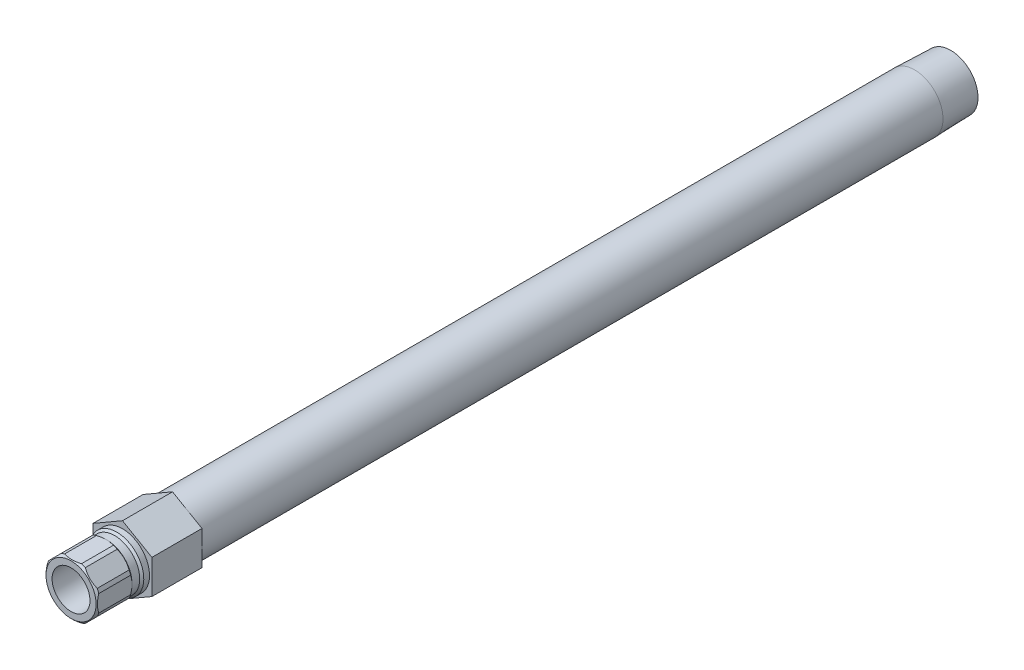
ISO-10303-21;
HEADER;
FILE_DESCRIPTION(('STEP AP214'),'2;1');
FILE_NAME('part.step','',(''),(''),'','','');
FILE_SCHEMA(('AUTOMOTIVE_DESIGN { 1 0 10303 214 1 1 1 1 }'));
ENDSEC;
DATA;
#1=APPLICATION_CONTEXT('core data for automotive mechanical design processes');
#2=APPLICATION_PROTOCOL_DEFINITION('international standard','automotive_design',2000,#1);
#3=PRODUCT_CONTEXT('',#1,'mechanical');
#4=PRODUCT('Part','Part','',(#3));
#5=PRODUCT_RELATED_PRODUCT_CATEGORY('part','',(#4));
#6=PRODUCT_DEFINITION_FORMATION('','',#4);
#7=PRODUCT_DEFINITION_CONTEXT('part definition',#1,'design');
#8=PRODUCT_DEFINITION('design','',#6,#7);
#9=PRODUCT_DEFINITION_SHAPE('','',#8);
#10=(LENGTH_UNIT() NAMED_UNIT(*) SI_UNIT(.MILLI.,.METRE.));
#11=(NAMED_UNIT(*) PLANE_ANGLE_UNIT() SI_UNIT($,.RADIAN.));
#12=(NAMED_UNIT(*) SI_UNIT($,.STERADIAN.) SOLID_ANGLE_UNIT());
#13=UNCERTAINTY_MEASURE_WITH_UNIT(LENGTH_MEASURE(1.E-05),#10,'distance_accuracy_value','');
#14=(GEOMETRIC_REPRESENTATION_CONTEXT(3) GLOBAL_UNCERTAINTY_ASSIGNED_CONTEXT((#13)) GLOBAL_UNIT_ASSIGNED_CONTEXT((#10,
#11,#12)) REPRESENTATION_CONTEXT('',''));
#15=CARTESIAN_POINT('',(0.,0.,0.));
#16=DIRECTION('',(0.,0.,1.));
#17=DIRECTION('',(1.,0.,0.));
#18=AXIS2_PLACEMENT_3D('',#15,#16,#17);
#19=CARTESIAN_POINT('',(0.,0.,0.));
#20=DIRECTION('',(0.,0.,-1.));
#21=DIRECTION('',(0.,1.,0.));
#22=AXIS2_PLACEMENT_3D('',#19,#20,#21);
#23=CYLINDRICAL_SURFACE('',#22,10.16);
#24=DIRECTION('',(0.,0.,-1.));
#25=VECTOR('',#24,1.);
#26=CARTESIAN_POINT('',(9.06826191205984,-4.58172739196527,0.));
#27=LINE('',#26,#25);
#28=CARTESIAN_POINT('',(9.06826191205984,-4.58172739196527,6.5786));
#29=VERTEX_POINT('',#28);
#30=CARTESIAN_POINT('',(9.06826191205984,-4.58172739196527,18.542));
#31=VERTEX_POINT('',#30);
#32=EDGE_CURVE('E535',#29,#31,#27,.F.);
#33=ORIENTED_EDGE('',*,*,#32,.F.);
#34=CARTESIAN_POINT('',(0.,0.,6.5786));
#35=DIRECTION('',(0.,0.,-1.));
#36=DIRECTION('',(0.,1.,0.));
#37=AXIS2_PLACEMENT_3D('',#34,#35,#36);
#38=CIRCLE('',#37,10.16);
#39=CARTESIAN_POINT('',(9.652,-3.17245898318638,6.5786));
#40=VERTEX_POINT('',#39);
#41=EDGE_CURVE('E214',#40,#29,#38,.T.);
#42=ORIENTED_EDGE('',*,*,#41,.F.);
#43=DIRECTION('',(0.,0.,-1.));
#44=VECTOR('',#43,1.);
#45=CARTESIAN_POINT('',(9.652,-3.17245898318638,0.));
#46=LINE('',#45,#44);
#47=CARTESIAN_POINT('',(9.652,-3.17245898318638,18.542));
#48=VERTEX_POINT('',#47);
#49=EDGE_CURVE('E410',#48,#40,#46,.T.);
#50=ORIENTED_EDGE('',*,*,#49,.F.);
#51=CARTESIAN_POINT('',(0.,0.,18.542));
#52=DIRECTION('',(0.,0.,-1.));
#53=DIRECTION('',(0.,1.,0.));
#54=AXIS2_PLACEMENT_3D('',#51,#52,#53);
#55=CIRCLE('',#54,10.16);
#56=EDGE_CURVE('E424',#48,#31,#55,.T.);
#57=ORIENTED_EDGE('',*,*,#56,.T.);
#58=EDGE_LOOP('',(#33,#42,#50,#57));
#59=FACE_BOUND('',#58,.T.);
#60=ADVANCED_FACE('F34',(#59),#23,.T.);
#61=DIRECTION('',(0.,0.,-1.));
#62=VECTOR('',#61,1.);
#63=CARTESIAN_POINT('',(9.652,3.17245898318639,0.));
#64=LINE('',#63,#62);
#65=CARTESIAN_POINT('',(9.652,3.1724589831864,6.57859999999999));
#66=VERTEX_POINT('',#65);
#67=CARTESIAN_POINT('',(9.652,3.17245898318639,18.542));
#68=VERTEX_POINT('',#67);
#69=EDGE_CURVE('E331',#66,#68,#64,.F.);
#70=ORIENTED_EDGE('',*,*,#69,.F.);
#71=CARTESIAN_POINT('',(9.06826191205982,4.5817273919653,6.5786));
#72=VERTEX_POINT('',#71);
#73=EDGE_CURVE('E217',#72,#66,#38,.T.);
#74=ORIENTED_EDGE('',*,*,#73,.F.);
#75=DIRECTION('',(0.,0.,-1.));
#76=VECTOR('',#75,1.);
#77=CARTESIAN_POINT('',(9.06826191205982,4.5817273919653,0.));
#78=LINE('',#77,#76);
#79=CARTESIAN_POINT('',(9.06826191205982,4.5817273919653,18.542));
#80=VERTEX_POINT('',#79);
#81=EDGE_CURVE('E403',#80,#72,#78,.T.);
#82=ORIENTED_EDGE('',*,*,#81,.F.);
#83=EDGE_CURVE('E231',#80,#68,#55,.T.);
#84=ORIENTED_EDGE('',*,*,#83,.T.);
#85=EDGE_LOOP('',(#70,#74,#82,#84));
#86=FACE_BOUND('',#85,.T.);
#87=ADVANCED_FACE('F425',(#86),#23,.T.);
#88=DIRECTION('',(0.,0.,-1.));
#89=VECTOR('',#88,1.);
#90=CARTESIAN_POINT('',(4.58172739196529,9.06826191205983,0.));
#91=LINE('',#90,#89);
#92=CARTESIAN_POINT('',(4.58172739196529,9.06826191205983,6.5786));
#93=VERTEX_POINT('',#92);
#94=CARTESIAN_POINT('',(4.58172739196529,9.06826191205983,18.542));
#95=VERTEX_POINT('',#94);
#96=EDGE_CURVE('E404',#93,#95,#91,.F.);
#97=ORIENTED_EDGE('',*,*,#96,.F.);
#98=CARTESIAN_POINT('',(3.17245898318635,9.65200000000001,6.5786));
#99=VERTEX_POINT('',#98);
#100=EDGE_CURVE('E219',#99,#93,#38,.T.);
#101=ORIENTED_EDGE('',*,*,#100,.F.);
#102=DIRECTION('',(0.,0.,-1.));
#103=VECTOR('',#102,1.);
#104=CARTESIAN_POINT('',(3.17245898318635,9.65200000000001,0.));
#105=LINE('',#104,#103);
#106=CARTESIAN_POINT('',(3.17245898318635,9.65200000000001,18.542));
#107=VERTEX_POINT('',#106);
#108=EDGE_CURVE('E397',#107,#99,#105,.T.);
#109=ORIENTED_EDGE('',*,*,#108,.F.);
#110=EDGE_CURVE('E227',#107,#95,#55,.T.);
#111=ORIENTED_EDGE('',*,*,#110,.T.);
#112=EDGE_LOOP('',(#97,#101,#109,#111));
#113=FACE_BOUND('',#112,.T.);
#114=ADVANCED_FACE('F444',(#113),#23,.T.);
#115=DIRECTION('',(0.,0.,-1.));
#116=VECTOR('',#115,1.);
#117=CARTESIAN_POINT('',(-3.17245898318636,9.65200000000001,0.));
#118=LINE('',#117,#116);
#119=CARTESIAN_POINT('',(-3.17245898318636,9.65200000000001,6.5786));
#120=VERTEX_POINT('',#119);
#121=CARTESIAN_POINT('',(-3.17245898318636,9.65200000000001,18.542));
#122=VERTEX_POINT('',#121);
#123=EDGE_CURVE('E398',#120,#122,#118,.F.);
#124=ORIENTED_EDGE('',*,*,#123,.F.);
#125=CARTESIAN_POINT('',(-4.5817273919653,9.06826191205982,6.5786));
#126=VERTEX_POINT('',#125);
#127=EDGE_CURVE('E224',#126,#120,#38,.T.);
#128=ORIENTED_EDGE('',*,*,#127,.F.);
#129=DIRECTION('',(0.,0.,-1.));
#130=VECTOR('',#129,1.);
#131=CARTESIAN_POINT('',(-4.5817273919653,9.06826191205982,0.));
#132=LINE('',#131,#130);
#133=CARTESIAN_POINT('',(-4.5817273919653,9.06826191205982,18.542));
#134=VERTEX_POINT('',#133);
#135=EDGE_CURVE('E54',#134,#126,#132,.T.);
#136=ORIENTED_EDGE('',*,*,#135,.F.);
#137=EDGE_CURVE('E223',#134,#122,#55,.T.);
#138=ORIENTED_EDGE('',*,*,#137,.T.);
#139=EDGE_LOOP('',(#124,#128,#136,#138));
#140=FACE_BOUND('',#139,.T.);
#141=ADVANCED_FACE('F439',(#140),#23,.T.);
#142=DIRECTION('',(0.,0.,-1.));
#143=VECTOR('',#142,1.);
#144=CARTESIAN_POINT('',(-9.06826191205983,4.58172739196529,0.));
#145=LINE('',#144,#143);
#146=CARTESIAN_POINT('',(-9.06826191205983,4.58172739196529,6.5786));
#147=VERTEX_POINT('',#146);
#148=CARTESIAN_POINT('',(-9.06826191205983,4.58172739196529,18.542));
#149=VERTEX_POINT('',#148);
#150=EDGE_CURVE('E394',#147,#149,#145,.F.);
#151=ORIENTED_EDGE('',*,*,#150,.F.);
#152=CARTESIAN_POINT('',(-9.652,3.17245898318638,6.5786));
#153=VERTEX_POINT('',#152);
#154=EDGE_CURVE('E447',#153,#147,#38,.T.);
#155=ORIENTED_EDGE('',*,*,#154,.F.);
#156=DIRECTION('',(0.,0.,-1.));
#157=VECTOR('',#156,1.);
#158=CARTESIAN_POINT('',(-9.652,3.17245898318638,0.));
#159=LINE('',#158,#157);
#160=CARTESIAN_POINT('',(-9.652,3.17245898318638,18.542));
#161=VERTEX_POINT('',#160);
#162=EDGE_CURVE('E62',#161,#153,#159,.T.);
#163=ORIENTED_EDGE('',*,*,#162,.F.);
#164=EDGE_CURVE('E430',#161,#149,#55,.T.);
#165=ORIENTED_EDGE('',*,*,#164,.T.);
#166=EDGE_LOOP('',(#151,#155,#163,#165));
#167=FACE_BOUND('',#166,.T.);
#168=ADVANCED_FACE('F554',(#167),#23,.T.);
#169=DIRECTION('',(0.,0.,-1.));
#170=VECTOR('',#169,1.);
#171=CARTESIAN_POINT('',(-9.652,-3.17245898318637,0.));
#172=LINE('',#171,#170);
#173=CARTESIAN_POINT('',(-9.652,-3.17245898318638,6.5786));
#174=VERTEX_POINT('',#173);
#175=CARTESIAN_POINT('',(-9.652,-3.17245898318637,18.542));
#176=VERTEX_POINT('',#175);
#177=EDGE_CURVE('E392',#174,#176,#172,.F.);
#178=ORIENTED_EDGE('',*,*,#177,.F.);
#179=CARTESIAN_POINT('',(-9.06826191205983,-4.58172739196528,6.5786));
#180=VERTEX_POINT('',#179);
#181=EDGE_CURVE('E218',#180,#174,#38,.T.);
#182=ORIENTED_EDGE('',*,*,#181,.F.);
#183=DIRECTION('',(0.,0.,-1.));
#184=VECTOR('',#183,1.);
#185=CARTESIAN_POINT('',(-9.06826191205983,-4.58172739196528,0.));
#186=LINE('',#185,#184);
#187=CARTESIAN_POINT('',(-9.06826191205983,-4.58172739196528,18.542));
#188=VERTEX_POINT('',#187);
#189=EDGE_CURVE('E269',#188,#180,#186,.T.);
#190=ORIENTED_EDGE('',*,*,#189,.F.);
#191=EDGE_CURVE('E428',#188,#176,#55,.T.);
#192=ORIENTED_EDGE('',*,*,#191,.T.);
#193=EDGE_LOOP('',(#178,#182,#190,#192));
#194=FACE_BOUND('',#193,.T.);
#195=ADVANCED_FACE('F548',(#194),#23,.T.);
#196=DIRECTION('',(0.,0.,-1.));
#197=VECTOR('',#196,1.);
#198=CARTESIAN_POINT('',(-4.58172739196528,-9.06826191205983,0.));
#199=LINE('',#198,#197);
#200=CARTESIAN_POINT('',(-4.58172739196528,-9.06826191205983,6.5786));
#201=VERTEX_POINT('',#200);
#202=CARTESIAN_POINT('',(-4.58172739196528,-9.06826191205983,18.542));
#203=VERTEX_POINT('',#202);
#204=EDGE_CURVE('E382',#201,#203,#199,.F.);
#205=ORIENTED_EDGE('',*,*,#204,.F.);
#206=CARTESIAN_POINT('',(-3.17245898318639,-9.65199999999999,6.5786));
#207=VERTEX_POINT('',#206);
#208=EDGE_CURVE('E215',#207,#201,#38,.T.);
#209=ORIENTED_EDGE('',*,*,#208,.F.);
#210=DIRECTION('',(0.,0.,-1.));
#211=VECTOR('',#210,1.);
#212=CARTESIAN_POINT('',(-3.17245898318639,-9.65199999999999,0.));
#213=LINE('',#212,#211);
#214=CARTESIAN_POINT('',(-3.17245898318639,-9.65199999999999,18.542));
#215=VERTEX_POINT('',#214);
#216=EDGE_CURVE('E192',#215,#207,#213,.T.);
#217=ORIENTED_EDGE('',*,*,#216,.F.);
#218=EDGE_CURVE('E391',#215,#203,#55,.T.);
#219=ORIENTED_EDGE('',*,*,#218,.T.);
#220=EDGE_LOOP('',(#205,#209,#217,#219));
#221=FACE_BOUND('',#220,.T.);
#222=ADVANCED_FACE('F389',(#221),#23,.T.);
#223=CARTESIAN_POINT('',(0.,0.,0.));
#224=DIRECTION('',(0.,0.,-1.));
#225=DIRECTION('',(0.,1.,0.));
#226=AXIS2_PLACEMENT_3D('',#223,#224,#225);
#227=CYLINDRICAL_SURFACE('',#226,7.112);
#228=CARTESIAN_POINT('',(0.,0.,1.524));
#229=DIRECTION('',(0.,0.,-1.));
#230=DIRECTION('',(0.,1.,0.));
#231=AXIS2_PLACEMENT_3D('',#228,#229,#230);
#232=CIRCLE('',#231,7.112);
#233=CARTESIAN_POINT('',(0.,7.112,1.524));
#234=VERTEX_POINT('',#233);
#235=EDGE_CURVE('E474',#234,#234,#232,.T.);
#236=ORIENTED_EDGE('',*,*,#235,.T.);
#237=EDGE_LOOP('',(#236));
#238=FACE_BOUND('',#237,.T.);
#239=CARTESIAN_POINT('',(0.,0.,19.304));
#240=DIRECTION('',(0.,0.,-1.));
#241=DIRECTION('',(0.,1.,0.));
#242=AXIS2_PLACEMENT_3D('',#239,#240,#241);
#243=CIRCLE('',#242,7.112);
#244=CARTESIAN_POINT('',(0.,7.112,19.304));
#245=VERTEX_POINT('',#244);
#246=EDGE_CURVE('E234',#245,#245,#243,.T.);
#247=ORIENTED_EDGE('',*,*,#246,.F.);
#248=EDGE_LOOP('',(#247));
#249=FACE_BOUND('',#248,.T.);
#250=ADVANCED_FACE('F36',(#238,#249),#227,.F.);
#251=CARTESIAN_POINT('',(0.,7.112,19.304));
#252=DIRECTION('',(0.,0.,1.));
#253=DIRECTION('',(0.,-1.,0.));
#254=AXIS2_PLACEMENT_3D('',#251,#252,#253);
#255=PLANE('',#254);
#256=ORIENTED_EDGE('',*,*,#246,.T.);
#257=EDGE_LOOP('',(#256));
#258=FACE_BOUND('',#257,.T.);
#259=CARTESIAN_POINT('',(0.,0.,19.304));
#260=DIRECTION('',(0.,0.,-1.));
#261=DIRECTION('',(0.,1.,0.));
#262=AXIS2_PLACEMENT_3D('',#259,#260,#261);
#263=CIRCLE('',#262,9.398);
#264=CARTESIAN_POINT('',(0.,9.398,19.304));
#265=VERTEX_POINT('',#264);
#266=EDGE_CURVE('E230',#265,#265,#263,.T.);
#267=ORIENTED_EDGE('',*,*,#266,.F.);
#268=EDGE_LOOP('',(#267));
#269=FACE_BOUND('',#268,.T.);
#270=ADVANCED_FACE('F275',(#258,#269),#255,.T.);
#271=CARTESIAN_POINT('',(0.,0.,18.542));
#272=DIRECTION('',(0.,0.,-1.));
#273=DIRECTION('',(0.,1.,0.));
#274=AXIS2_PLACEMENT_3D('',#271,#272,#273);
#275=CONICAL_SURFACE('',#274,10.16,0.785398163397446);
#276=CARTESIAN_POINT('',(9.06871478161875,-4.58127452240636,18.5418));
#277=CARTESIAN_POINT('',(8.8974665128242,-4.7525227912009,18.6174888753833));
#278=CARTESIAN_POINT('',(8.72454398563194,-4.92544531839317,18.6860001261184));
#279=CARTESIAN_POINT('',(8.37571487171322,-5.27427443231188,18.8068689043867));
#280=CARTESIAN_POINT('',(8.1998052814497,-5.4501840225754,18.85920901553));
#281=CARTESIAN_POINT('',(7.84982827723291,-5.80016102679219,18.9447662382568));
#282=CARTESIAN_POINT('',(7.67581225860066,-5.97417704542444,18.9783973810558));
#283=CARTESIAN_POINT('',(7.32656572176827,-6.32342358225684,19.0270891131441));
#284=CARTESIAN_POINT('',(7.1513358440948,-6.4986534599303,19.0421588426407));
#285=CARTESIAN_POINT('',(6.77605057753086,-6.87393872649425,19.0538859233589));
#286=CARTESIAN_POINT('',(6.57594647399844,-7.07404283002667,19.0476773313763));
#287=CARTESIAN_POINT('',(6.17675989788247,-7.47322940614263,19.0106603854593));
#288=CARTESIAN_POINT('',(5.97767829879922,-7.67231100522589,18.9798336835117));
#289=CARTESIAN_POINT('',(5.57666706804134,-8.07332223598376,18.8939894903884));
#290=CARTESIAN_POINT('',(5.37480504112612,-8.27518426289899,18.8383431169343));
#291=CARTESIAN_POINT('',(5.07491153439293,-8.57507776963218,18.7386783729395));
#292=CARTESIAN_POINT('',(4.97548345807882,-8.67450584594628,18.7027814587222));
#293=CARTESIAN_POINT('',(4.77762502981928,-8.87236427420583,18.6259657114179));
#294=CARTESIAN_POINT('',(4.67919445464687,-8.97079484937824,18.5850480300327));
#295=CARTESIAN_POINT('',(4.58127452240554,-9.06871478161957,18.5417999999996));
#296=B_SPLINE_CURVE_WITH_KNOTS('',3,(#276,#277,#278,#279,#280,#281,#282,#283,#284,#285,#286,
#287,#288,#289,#290,#291,#292,#293,#294,#295),.UNSPECIFIED.,.F.,.F.,(4,2,2,2,2,2,2,2,2,4),(0.,
0.761268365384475,1.52335378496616,2.26782503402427,3.01192953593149,3.85997332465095,
4.70864975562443,5.5801727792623,6.01546212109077,6.45065179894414),.UNSPECIFIED.);
#297=CARTESIAN_POINT('',(4.58172739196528,-9.06826191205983,18.542));
#298=VERTEX_POINT('',#297);
#299=EDGE_CURVE('E530',#31,#298,#296,.T.);
#300=ORIENTED_EDGE('',*,*,#299,.F.);
#301=ORIENTED_EDGE('',*,*,#56,.F.);
#302=CARTESIAN_POINT('',(9.652,-7.71050187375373,16.3483388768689));
#303=CARTESIAN_POINT('',(9.652,-7.52475481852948,16.4642553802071));
#304=CARTESIAN_POINT('',(9.652,-7.33786285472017,16.5783624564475));
#305=CARTESIAN_POINT('',(9.652,-6.96152272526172,16.8023812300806));
#306=CARTESIAN_POINT('',(9.652,-6.77207395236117,16.9122919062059));
#307=CARTESIAN_POINT('',(9.652,-6.38961701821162,17.1277502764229));
#308=CARTESIAN_POINT('',(9.652,-6.19659699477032,17.2332770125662));
#309=CARTESIAN_POINT('',(9.652,-5.8076024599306,17.4386922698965));
#310=CARTESIAN_POINT('',(9.652,-5.61162813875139,17.5385811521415));
#311=CARTESIAN_POINT('',(9.652,-5.01021259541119,17.8328232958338));
#312=CARTESIAN_POINT('',(9.652,-4.59965798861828,18.0169416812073));
#313=CARTESIAN_POINT('',(9.652,-3.76461195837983,18.3488686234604));
#314=CARTESIAN_POINT('',(9.652,-3.34014745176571,18.4967430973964));
#315=CARTESIAN_POINT('',(9.652,-2.66836152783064,18.6905975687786));
#316=CARTESIAN_POINT('',(9.652,-2.42567962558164,18.7527238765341));
#317=CARTESIAN_POINT('',(9.652,-1.93662453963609,18.860517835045));
#318=CARTESIAN_POINT('',(9.652,-1.69025117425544,18.9061846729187));
#319=CARTESIAN_POINT('',(9.652,-1.1971622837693,18.9790662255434));
#320=CARTESIAN_POINT('',(9.652,-0.950472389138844,19.0064526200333));
#321=CARTESIAN_POINT('',(9.652,-0.455710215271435,19.0423990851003));
#322=CARTESIAN_POINT('',(9.652,-0.207637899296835,19.0509586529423));
#323=CARTESIAN_POINT('',(9.652,0.333683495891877,19.048681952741));
#324=CARTESIAN_POINT('',(9.652,0.626923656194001,19.0340251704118));
#325=CARTESIAN_POINT('',(9.652,1.21094277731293,18.9786837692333));
#326=CARTESIAN_POINT('',(9.652,1.50172122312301,18.9379938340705));
#327=CARTESIAN_POINT('',(9.652,2.08266136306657,18.8320509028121));
#328=CARTESIAN_POINT('',(9.652,2.37276468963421,18.7664820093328));
#329=CARTESIAN_POINT('',(9.652,2.94714147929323,18.6138865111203));
#330=CARTESIAN_POINT('',(9.652,3.2314158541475,18.5268632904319));
#331=CARTESIAN_POINT('',(9.652,3.82869981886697,18.3226103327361));
#332=CARTESIAN_POINT('',(9.652,4.14087760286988,18.2029681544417));
#333=CARTESIAN_POINT('',(9.652,4.75742701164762,17.9448741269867));
#334=CARTESIAN_POINT('',(9.652,5.06179505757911,17.8064138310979));
#335=CARTESIAN_POINT('',(9.652,5.66409479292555,17.5139015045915));
#336=CARTESIAN_POINT('',(9.652,5.9620026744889,17.3598008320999));
#337=CARTESIAN_POINT('',(9.652,6.55107386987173,17.0393844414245));
#338=CARTESIAN_POINT('',(9.652,6.84223818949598,16.8730705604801));
#339=CARTESIAN_POINT('',(9.652,7.40668231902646,16.5376791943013));
#340=CARTESIAN_POINT('',(9.652,7.68020242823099,16.3690040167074));
#341=CARTESIAN_POINT('',(9.652,8.22250898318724,16.0241853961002));
#342=CARTESIAN_POINT('',(9.652,8.49129505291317,15.848041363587));
#343=CARTESIAN_POINT('',(9.652,9.02258177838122,15.4910339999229));
#344=CARTESIAN_POINT('',(9.652,9.28511552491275,15.3102197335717));
#345=CARTESIAN_POINT('',(9.652,9.80652727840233,14.9435456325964));
#346=CARTESIAN_POINT('',(9.652,10.0654063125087,14.7576872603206));
#347=CARTESIAN_POINT('',(9.652,10.3227473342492,14.5697596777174));
#348=B_SPLINE_CURVE_WITH_KNOTS('',3,(#302,#303,#304,#305,#306,#307,#308,#309,#310,#311,#312,
#313,#314,#315,#316,#317,#318,#319,#320,#321,#322,#323,#324,#325,#326,#327,#328,#329,#330,#331,
#332,#333,#334,#335,#336,#337,#338,#339,#340,#341,#342,#343,#344,#345,#346,#347),.UNSPECIFIED.,
.F.,.F.,(4,2,2,2,2,2,2,2,2,2,2,2,2,2,2,2,2,2,2,2,2,2,4),(0.,0.656855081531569,1.31386901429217,
1.97372850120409,2.63354568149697,3.98211483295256,5.32821282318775,6.07925616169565,
6.83033658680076,7.5742601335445,8.31820354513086,9.1977741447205,10.0775244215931,
10.9688407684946,11.8600166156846,12.8622077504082,13.8648502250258,14.8707124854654,
15.8764237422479,16.8403261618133,17.8043048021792,18.7605668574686,19.7165545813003),.UNSPECIFIED.);
#349=EDGE_CURVE('E323',#68,#48,#348,.F.);
#350=ORIENTED_EDGE('',*,*,#349,.F.);
#351=ORIENTED_EDGE('',*,*,#83,.F.);
#352=CARTESIAN_POINT('',(4.58127452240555,9.06871478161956,18.5417999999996));
#353=CARTESIAN_POINT('',(4.75252279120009,8.89746651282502,18.617488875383));
#354=CARTESIAN_POINT('',(4.92544531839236,8.72454398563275,18.6860001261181));
#355=CARTESIAN_POINT('',(5.27427443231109,8.37571487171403,18.8068689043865));
#356=CARTESIAN_POINT('',(5.45018402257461,8.19980528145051,18.8592090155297));
#357=CARTESIAN_POINT('',(5.8001610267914,7.84982827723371,18.9447662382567));
#358=CARTESIAN_POINT('',(5.97417704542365,7.67581225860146,18.9783973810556));
#359=CARTESIAN_POINT('',(6.32342358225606,7.32656572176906,19.027089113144));
#360=CARTESIAN_POINT('',(6.49865345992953,7.15133584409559,19.0421588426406));
#361=CARTESIAN_POINT('',(6.87393872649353,6.77605057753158,19.0538859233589));
#362=CARTESIAN_POINT('',(7.07404283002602,6.5759464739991,19.0476773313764));
#363=CARTESIAN_POINT('',(7.47322940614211,6.17675989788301,19.0106603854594));
#364=CARTESIAN_POINT('',(7.67231100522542,5.97767829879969,18.9798336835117));
#365=CARTESIAN_POINT('',(8.07332223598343,5.57666706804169,18.8939894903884));
#366=CARTESIAN_POINT('',(8.27518426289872,5.37480504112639,18.8383431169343));
#367=CARTESIAN_POINT('',(8.57507776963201,5.07491153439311,18.7386783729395));
#368=CARTESIAN_POINT('',(8.67450584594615,4.97548345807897,18.7027814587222));
#369=CARTESIAN_POINT('',(8.87236427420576,4.77762502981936,18.6259657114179));
#370=CARTESIAN_POINT('',(8.9707948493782,4.67919445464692,18.5850480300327));
#371=CARTESIAN_POINT('',(9.06871478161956,4.58127452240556,18.5417999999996));
#372=B_SPLINE_CURVE_WITH_KNOTS('',3,(#352,#353,#354,#355,#356,#357,#358,#359,#360,#361,#362,
#363,#364,#365,#366,#367,#368,#369,#370,#371),.UNSPECIFIED.,.F.,.F.,(4,2,2,2,2,2,2,2,2,4),(0.,
0.761268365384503,1.52335378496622,2.26782503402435,3.01192953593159,3.85997332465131,
4.70864975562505,5.5801727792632,6.01546212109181,6.45065179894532),.UNSPECIFIED.);
#373=EDGE_CURVE('E315',#95,#80,#372,.T.);
#374=ORIENTED_EDGE('',*,*,#373,.F.);
#375=ORIENTED_EDGE('',*,*,#110,.F.);
#376=CARTESIAN_POINT('',(-7.71050187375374,9.65200000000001,16.3483388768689));
#377=CARTESIAN_POINT('',(-7.52475481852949,9.65200000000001,16.4642553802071));
#378=CARTESIAN_POINT('',(-7.33786285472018,9.65200000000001,16.5783624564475));
#379=CARTESIAN_POINT('',(-6.96152272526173,9.65200000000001,16.8023812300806));
#380=CARTESIAN_POINT('',(-6.77207395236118,9.65200000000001,16.9122919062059));
#381=CARTESIAN_POINT('',(-6.38961701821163,9.65200000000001,17.1277502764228));
#382=CARTESIAN_POINT('',(-6.19659699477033,9.65200000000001,17.2332770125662));
#383=CARTESIAN_POINT('',(-5.8076024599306,9.65200000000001,17.4386922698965));
#384=CARTESIAN_POINT('',(-5.6116281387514,9.65200000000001,17.5385811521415));
#385=CARTESIAN_POINT('',(-5.01021259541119,9.65200000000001,17.8328232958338));
#386=CARTESIAN_POINT('',(-4.59965798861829,9.65200000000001,18.0169416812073));
#387=CARTESIAN_POINT('',(-3.76461195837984,9.65200000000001,18.3488686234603));
#388=CARTESIAN_POINT('',(-3.34014745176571,9.65200000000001,18.4967430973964));
#389=CARTESIAN_POINT('',(-2.66836152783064,9.65200000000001,18.6905975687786));
#390=CARTESIAN_POINT('',(-2.42567962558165,9.65200000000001,18.7527238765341));
#391=CARTESIAN_POINT('',(-1.9366245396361,9.65200000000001,18.860517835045));
#392=CARTESIAN_POINT('',(-1.69025117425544,9.65200000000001,18.9061846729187));
#393=CARTESIAN_POINT('',(-1.1971622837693,9.65200000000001,18.9790662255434));
#394=CARTESIAN_POINT('',(-0.950472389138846,9.65200000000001,19.0064526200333));
#395=CARTESIAN_POINT('',(-0.455710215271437,9.65200000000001,19.0423990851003));
#396=CARTESIAN_POINT('',(-0.207637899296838,9.65200000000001,19.0509586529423));
#397=CARTESIAN_POINT('',(0.333683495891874,9.65200000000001,19.0486819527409));
#398=CARTESIAN_POINT('',(0.626923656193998,9.65200000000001,19.0340251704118));
#399=CARTESIAN_POINT('',(1.21094277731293,9.65200000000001,18.9786837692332));
#400=CARTESIAN_POINT('',(1.501721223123,9.65200000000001,18.9379938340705));
#401=CARTESIAN_POINT('',(2.08266136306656,9.65200000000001,18.832050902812));
#402=CARTESIAN_POINT('',(2.3727646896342,9.65200000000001,18.7664820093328));
#403=CARTESIAN_POINT('',(2.94714147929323,9.65200000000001,18.6138865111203));
#404=CARTESIAN_POINT('',(3.23141585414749,9.65200000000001,18.5268632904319));
#405=CARTESIAN_POINT('',(3.82869981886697,9.65200000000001,18.3226103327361));
#406=CARTESIAN_POINT('',(4.14087760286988,9.65200000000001,18.2029681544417));
#407=CARTESIAN_POINT('',(4.75742701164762,9.65200000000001,17.9448741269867));
#408=CARTESIAN_POINT('',(5.0617950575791,9.65200000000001,17.8064138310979));
#409=CARTESIAN_POINT('',(5.66409479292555,9.65200000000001,17.5139015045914));
#410=CARTESIAN_POINT('',(5.9620026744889,9.65200000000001,17.3598008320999));
#411=CARTESIAN_POINT('',(6.55107386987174,9.65200000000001,17.0393844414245));
#412=CARTESIAN_POINT('',(6.84223818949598,9.65200000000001,16.8730705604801));
#413=CARTESIAN_POINT('',(7.40668231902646,9.65200000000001,16.5376791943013));
#414=CARTESIAN_POINT('',(7.680202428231,9.65200000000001,16.3690040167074));
#415=CARTESIAN_POINT('',(8.22250898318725,9.65200000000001,16.0241853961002));
#416=CARTESIAN_POINT('',(8.49129505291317,9.65200000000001,15.8480413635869));
#417=CARTESIAN_POINT('',(9.02258177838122,9.65200000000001,15.4910339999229));
#418=CARTESIAN_POINT('',(9.28511552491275,9.65200000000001,15.3102197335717));
#419=CARTESIAN_POINT('',(9.80652727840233,9.65200000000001,14.9435456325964));
#420=CARTESIAN_POINT('',(10.0654063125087,9.65200000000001,14.7576872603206));
#421=CARTESIAN_POINT('',(10.3227473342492,9.65200000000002,14.5697596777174));
#422=B_SPLINE_CURVE_WITH_KNOTS('',3,(#376,#377,#378,#379,#380,#381,#382,#383,#384,#385,#386,
#387,#388,#389,#390,#391,#392,#393,#394,#395,#396,#397,#398,#399,#400,#401,#402,#403,#404,#405,
#406,#407,#408,#409,#410,#411,#412,#413,#414,#415,#416,#417,#418,#419,#420,#421),.UNSPECIFIED.,
.F.,.F.,(4,2,2,2,2,2,2,2,2,2,2,2,2,2,2,2,2,2,2,2,2,2,4),(0.,0.656855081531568,1.31386901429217,
1.97372850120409,2.63354568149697,3.98211483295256,5.32821282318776,6.07925616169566,
6.83033658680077,7.57426013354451,8.31820354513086,9.1977741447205,10.0775244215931,
10.9688407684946,11.8600166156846,12.8622077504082,13.8648502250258,14.8707124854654,
15.8764237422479,16.8403261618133,17.8043048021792,18.7605668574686,19.7165545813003),.UNSPECIFIED.);
#423=EDGE_CURVE('E307',#122,#107,#422,.T.);
#424=ORIENTED_EDGE('',*,*,#423,.F.);
#425=ORIENTED_EDGE('',*,*,#137,.F.);
#426=CARTESIAN_POINT('',(-9.06871478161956,4.58127452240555,18.5417999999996));
#427=CARTESIAN_POINT('',(-8.89746651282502,4.7525227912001,18.617488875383));
#428=CARTESIAN_POINT('',(-8.72454398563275,4.92544531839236,18.6860001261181));
#429=CARTESIAN_POINT('',(-8.37571487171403,5.27427443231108,18.8068689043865));
#430=CARTESIAN_POINT('',(-8.19980528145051,5.45018402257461,18.8592090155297));
#431=CARTESIAN_POINT('',(-7.84982827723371,5.8001610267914,18.9447662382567));
#432=CARTESIAN_POINT('',(-7.67581225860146,5.97417704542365,18.9783973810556));
#433=CARTESIAN_POINT('',(-7.32656572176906,6.32342358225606,19.027089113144));
#434=CARTESIAN_POINT('',(-7.15133584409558,6.49865345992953,19.0421588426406));
#435=CARTESIAN_POINT('',(-6.77605057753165,6.87393872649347,19.0538859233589));
#436=CARTESIAN_POINT('',(-6.57594647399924,7.07404283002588,19.0476773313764));
#437=CARTESIAN_POINT('',(-6.17675989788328,7.47322940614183,19.0106603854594));
#438=CARTESIAN_POINT('',(-5.97767829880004,7.67231100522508,18.9798336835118));
#439=CARTESIAN_POINT('',(-5.57666706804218,8.07332223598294,18.8939894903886));
#440=CARTESIAN_POINT('',(-5.37480504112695,8.27518426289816,18.8383431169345));
#441=CARTESIAN_POINT('',(-5.07491153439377,8.57507776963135,18.7386783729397));
#442=CARTESIAN_POINT('',(-4.97548345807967,8.67450584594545,18.7027814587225));
#443=CARTESIAN_POINT('',(-4.77762502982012,8.87236427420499,18.6259657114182));
#444=CARTESIAN_POINT('',(-4.67919445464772,8.9707948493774,18.585048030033));
#445=CARTESIAN_POINT('',(-4.58127452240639,9.06871478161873,18.5418));
#446=B_SPLINE_CURVE_WITH_KNOTS('',3,(#426,#427,#428,#429,#430,#431,#432,#433,#434,#435,#436,
#437,#438,#439,#440,#441,#442,#443,#444,#445),.UNSPECIFIED.,.F.,.F.,(4,2,2,2,2,2,2,2,2,4),(0.,
0.7612683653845,1.52335378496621,2.26782503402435,3.01192953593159,3.85997332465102,
4.70864975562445,5.58017277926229,6.01546212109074,6.45065179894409),.UNSPECIFIED.);
#447=EDGE_CURVE('E298',#149,#134,#446,.T.);
#448=ORIENTED_EDGE('',*,*,#447,.F.);
#449=ORIENTED_EDGE('',*,*,#164,.F.);
#450=CARTESIAN_POINT('',(-9.652,-7.71050187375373,16.3483388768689));
#451=CARTESIAN_POINT('',(-9.652,-7.52475481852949,16.4642553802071));
#452=CARTESIAN_POINT('',(-9.652,-7.33786285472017,16.5783624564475));
#453=CARTESIAN_POINT('',(-9.652,-6.96152272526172,16.8023812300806));
#454=CARTESIAN_POINT('',(-9.652,-6.77207395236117,16.9122919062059));
#455=CARTESIAN_POINT('',(-9.652,-6.38961701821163,17.1277502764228));
#456=CARTESIAN_POINT('',(-9.652,-6.19659699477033,17.2332770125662));
#457=CARTESIAN_POINT('',(-9.652,-5.8076024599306,17.4386922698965));
#458=CARTESIAN_POINT('',(-9.652,-5.6116281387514,17.5385811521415));
#459=CARTESIAN_POINT('',(-9.652,-5.01021259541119,17.8328232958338));
#460=CARTESIAN_POINT('',(-9.652,-4.59965798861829,18.0169416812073));
#461=CARTESIAN_POINT('',(-9.652,-3.76461195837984,18.3488686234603));
#462=CARTESIAN_POINT('',(-9.652,-3.34014745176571,18.4967430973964));
#463=CARTESIAN_POINT('',(-9.652,-2.66836152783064,18.6905975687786));
#464=CARTESIAN_POINT('',(-9.652,-2.42567962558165,18.7527238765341));
#465=CARTESIAN_POINT('',(-9.652,-1.9366245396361,18.860517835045));
#466=CARTESIAN_POINT('',(-9.652,-1.69025117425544,18.9061846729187));
#467=CARTESIAN_POINT('',(-9.652,-1.1971622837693,18.9790662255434));
#468=CARTESIAN_POINT('',(-9.652,-0.950472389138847,19.0064526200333));
#469=CARTESIAN_POINT('',(-9.652,-0.455710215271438,19.0423990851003));
#470=CARTESIAN_POINT('',(-9.652,-0.207637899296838,19.0509586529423));
#471=CARTESIAN_POINT('',(-9.652,0.333683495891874,19.0486819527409));
#472=CARTESIAN_POINT('',(-9.652,0.626923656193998,19.0340251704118));
#473=CARTESIAN_POINT('',(-9.652,1.21094277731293,18.9786837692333));
#474=CARTESIAN_POINT('',(-9.652,1.501721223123,18.9379938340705));
#475=CARTESIAN_POINT('',(-9.652,2.08266136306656,18.8320509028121));
#476=CARTESIAN_POINT('',(-9.652,2.3727646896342,18.7664820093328));
#477=CARTESIAN_POINT('',(-9.652,2.94714147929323,18.6138865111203));
#478=CARTESIAN_POINT('',(-9.652,3.2314158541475,18.5268632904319));
#479=CARTESIAN_POINT('',(-9.652,3.82869981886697,18.3226103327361));
#480=CARTESIAN_POINT('',(-9.652,4.14087760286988,18.2029681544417));
#481=CARTESIAN_POINT('',(-9.652,4.75742701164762,17.9448741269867));
#482=CARTESIAN_POINT('',(-9.652,5.06179505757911,17.8064138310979));
#483=CARTESIAN_POINT('',(-9.652,5.66409479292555,17.5139015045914));
#484=CARTESIAN_POINT('',(-9.652,5.9620026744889,17.3598008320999));
#485=CARTESIAN_POINT('',(-9.652,6.55107386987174,17.0393844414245));
#486=CARTESIAN_POINT('',(-9.652,6.84223818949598,16.8730705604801));
#487=CARTESIAN_POINT('',(-9.652,7.40668231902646,16.5376791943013));
#488=CARTESIAN_POINT('',(-9.652,7.68020242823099,16.3690040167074));
#489=CARTESIAN_POINT('',(-9.652,8.22250898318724,16.0241853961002));
#490=CARTESIAN_POINT('',(-9.652,8.49129505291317,15.848041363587));
#491=CARTESIAN_POINT('',(-9.652,9.02258177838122,15.4910339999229));
#492=CARTESIAN_POINT('',(-9.652,9.28511552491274,15.3102197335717));
#493=CARTESIAN_POINT('',(-9.652,9.80652727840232,14.9435456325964));
#494=CARTESIAN_POINT('',(-9.652,10.0654063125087,14.7576872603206));
#495=CARTESIAN_POINT('',(-9.652,10.3227473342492,14.5697596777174));
#496=B_SPLINE_CURVE_WITH_KNOTS('',3,(#450,#451,#452,#453,#454,#455,#456,#457,#458,#459,#460,
#461,#462,#463,#464,#465,#466,#467,#468,#469,#470,#471,#472,#473,#474,#475,#476,#477,#478,#479,
#480,#481,#482,#483,#484,#485,#486,#487,#488,#489,#490,#491,#492,#493,#494,#495),.UNSPECIFIED.,
.F.,.F.,(4,2,2,2,2,2,2,2,2,2,2,2,2,2,2,2,2,2,2,2,2,2,4),(0.,0.656855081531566,1.31386901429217,
1.97372850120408,2.63354568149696,3.98211483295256,5.32821282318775,6.07925616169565,
6.83033658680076,7.5742601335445,8.31820354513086,9.19777414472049,10.0775244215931,
10.9688407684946,11.8600166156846,12.8622077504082,13.8648502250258,14.8707124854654,
15.8764237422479,16.8403261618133,17.8043048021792,18.7605668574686,19.7165545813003),.UNSPECIFIED.);
#497=EDGE_CURVE('E290',#176,#161,#496,.T.);
#498=ORIENTED_EDGE('',*,*,#497,.F.);
#499=ORIENTED_EDGE('',*,*,#191,.F.);
#500=CARTESIAN_POINT('',(-4.58127452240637,-9.06871478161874,18.5418));
#501=CARTESIAN_POINT('',(-4.75252279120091,-8.8974665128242,18.6174888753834));
#502=CARTESIAN_POINT('',(-4.92544531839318,-8.72454398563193,18.6860001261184));
#503=CARTESIAN_POINT('',(-5.27427443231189,-8.37571487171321,18.8068689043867));
#504=CARTESIAN_POINT('',(-5.45018402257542,-8.19980528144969,18.85920901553));
#505=CARTESIAN_POINT('',(-5.8001610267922,-7.8498282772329,18.9447662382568));
#506=CARTESIAN_POINT('',(-5.97417704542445,-7.67581225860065,18.9783973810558));
#507=CARTESIAN_POINT('',(-6.32342358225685,-7.32656572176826,19.0270891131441));
#508=CARTESIAN_POINT('',(-6.49865345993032,-7.15133584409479,19.0421588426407));
#509=CARTESIAN_POINT('',(-6.87393872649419,-6.77605057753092,19.0538859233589));
#510=CARTESIAN_POINT('',(-7.07404283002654,-6.57594647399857,19.0476773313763));
#511=CARTESIAN_POINT('',(-7.47322940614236,-6.17675989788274,19.0106603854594));
#512=CARTESIAN_POINT('',(-7.67231100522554,-5.97767829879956,18.9798336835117));
#513=CARTESIAN_POINT('',(-8.07332223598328,-5.57666706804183,18.8939894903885));
#514=CARTESIAN_POINT('',(-8.27518426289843,-5.37480504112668,18.8383431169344));
#515=CARTESIAN_POINT('',(-8.57507776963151,-5.07491153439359,18.7386783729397));
#516=CARTESIAN_POINT('',(-8.67450584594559,-4.97548345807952,18.7027814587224));
#517=CARTESIAN_POINT('',(-8.87236427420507,-4.77762502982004,18.6259657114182));
#518=CARTESIAN_POINT('',(-8.97079484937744,-4.67919445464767,18.585048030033));
#519=CARTESIAN_POINT('',(-9.06871478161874,-4.58127452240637,18.5418));
#520=B_SPLINE_CURVE_WITH_KNOTS('',3,(#500,#501,#502,#503,#504,#505,#506,#507,#508,#509,#510,
#511,#512,#513,#514,#515,#516,#517,#518,#519),.UNSPECIFIED.,.F.,.F.,(4,2,2,2,2,2,2,2,2,4),(0.,
0.761268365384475,1.52335378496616,2.26782503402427,3.01192953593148,3.85997332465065,
4.70864975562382,5.58017277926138,6.01546212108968,6.4506517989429),.UNSPECIFIED.);
#521=EDGE_CURVE('E283',#203,#188,#520,.T.);
#522=ORIENTED_EDGE('',*,*,#521,.F.);
#523=ORIENTED_EDGE('',*,*,#218,.F.);
#524=CARTESIAN_POINT('',(-7.71050187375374,-9.652,16.3483388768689));
#525=CARTESIAN_POINT('',(-7.5247548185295,-9.652,16.4642553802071));
#526=CARTESIAN_POINT('',(-7.33786285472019,-9.652,16.5783624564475));
#527=CARTESIAN_POINT('',(-6.96152272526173,-9.652,16.8023812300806));
#528=CARTESIAN_POINT('',(-6.77207395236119,-9.652,16.9122919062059));
#529=CARTESIAN_POINT('',(-6.38961701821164,-9.652,17.1277502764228));
#530=CARTESIAN_POINT('',(-6.19659699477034,-9.652,17.2332770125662));
#531=CARTESIAN_POINT('',(-5.80760245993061,-9.652,17.4386922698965));
#532=CARTESIAN_POINT('',(-5.61162813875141,-9.65199999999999,17.5385811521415));
#533=CARTESIAN_POINT('',(-5.0102125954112,-9.65199999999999,17.8328232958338));
#534=CARTESIAN_POINT('',(-4.5996579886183,-9.65199999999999,18.0169416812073));
#535=CARTESIAN_POINT('',(-3.76461195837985,-9.65199999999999,18.3488686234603));
#536=CARTESIAN_POINT('',(-3.34014745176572,-9.65199999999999,18.4967430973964));
#537=CARTESIAN_POINT('',(-2.66836152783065,-9.65199999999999,18.6905975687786));
#538=CARTESIAN_POINT('',(-2.42567962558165,-9.65199999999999,18.7527238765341));
#539=CARTESIAN_POINT('',(-1.9366245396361,-9.65199999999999,18.860517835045));
#540=CARTESIAN_POINT('',(-1.69025117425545,-9.65199999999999,18.9061846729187));
#541=CARTESIAN_POINT('',(-1.19716228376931,-9.65199999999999,18.9790662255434));
#542=CARTESIAN_POINT('',(-0.950472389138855,-9.65199999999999,19.0064526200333));
#543=CARTESIAN_POINT('',(-0.455710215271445,-9.65199999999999,19.0423990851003));
#544=CARTESIAN_POINT('',(-0.207637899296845,-9.65199999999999,19.0509586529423));
#545=CARTESIAN_POINT('',(0.333683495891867,-9.65199999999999,19.048681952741));
#546=CARTESIAN_POINT('',(0.626923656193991,-9.65199999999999,19.0340251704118));
#547=CARTESIAN_POINT('',(1.21094277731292,-9.65199999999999,18.9786837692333));
#548=CARTESIAN_POINT('',(1.501721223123,-9.65199999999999,18.9379938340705));
#549=CARTESIAN_POINT('',(2.08266136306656,-9.65199999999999,18.8320509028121));
#550=CARTESIAN_POINT('',(2.3727646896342,-9.65199999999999,18.7664820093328));
#551=CARTESIAN_POINT('',(2.94714147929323,-9.65199999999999,18.6138865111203));
#552=CARTESIAN_POINT('',(3.23141585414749,-9.65199999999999,18.5268632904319));
#553=CARTESIAN_POINT('',(3.82869981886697,-9.65199999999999,18.3226103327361));
#554=CARTESIAN_POINT('',(4.14087760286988,-9.65199999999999,18.2029681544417));
#555=CARTESIAN_POINT('',(4.75742701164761,-9.65199999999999,17.9448741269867));
#556=CARTESIAN_POINT('',(5.0617950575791,-9.65199999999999,17.8064138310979));
#557=CARTESIAN_POINT('',(5.66409479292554,-9.65199999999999,17.5139015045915));
#558=CARTESIAN_POINT('',(5.96200267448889,-9.65199999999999,17.3598008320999));
#559=CARTESIAN_POINT('',(6.55107386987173,-9.65199999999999,17.0393844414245));
#560=CARTESIAN_POINT('',(6.84223818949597,-9.65199999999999,16.8730705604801));
#561=CARTESIAN_POINT('',(7.40668231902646,-9.65199999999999,16.5376791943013));
#562=CARTESIAN_POINT('',(7.68020242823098,-9.65199999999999,16.3690040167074));
#563=CARTESIAN_POINT('',(8.22250898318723,-9.65199999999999,16.0241853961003));
#564=CARTESIAN_POINT('',(8.49129505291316,-9.65199999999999,15.848041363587));
#565=CARTESIAN_POINT('',(9.02258177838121,-9.65199999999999,15.4910339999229));
#566=CARTESIAN_POINT('',(9.28511552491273,-9.65199999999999,15.3102197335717));
#567=CARTESIAN_POINT('',(9.80652727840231,-9.65199999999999,14.9435456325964));
#568=CARTESIAN_POINT('',(10.0654063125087,-9.65199999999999,14.7576872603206));
#569=CARTESIAN_POINT('',(10.3227473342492,-9.65199999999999,14.5697596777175));
#570=B_SPLINE_CURVE_WITH_KNOTS('',3,(#524,#525,#526,#527,#528,#529,#530,#531,#532,#533,#534,
#535,#536,#537,#538,#539,#540,#541,#542,#543,#544,#545,#546,#547,#548,#549,#550,#551,#552,#553,
#554,#555,#556,#557,#558,#559,#560,#561,#562,#563,#564,#565,#566,#567,#568,#569),.UNSPECIFIED.,
.F.,.F.,(4,2,2,2,2,2,2,2,2,2,2,2,2,2,2,2,2,2,2,2,2,2,4),(0.,0.656855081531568,1.31386901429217,
1.97372850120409,2.63354568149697,3.98211483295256,5.32821282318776,6.07925616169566,
6.83033658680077,7.57426013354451,8.31820354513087,9.1977741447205,10.0775244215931,
10.9688407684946,11.8600166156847,12.8622077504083,13.8648502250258,14.8707124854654,
15.8764237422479,16.8403261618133,17.8043048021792,18.7605668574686,19.7165545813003),.UNSPECIFIED.);
#571=CARTESIAN_POINT('',(3.1724589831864,-9.65199999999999,18.542));
#572=VERTEX_POINT('',#571);
#573=EDGE_CURVE('E208',#572,#215,#570,.F.);
#574=ORIENTED_EDGE('',*,*,#573,.F.);
#575=EDGE_CURVE('E207',#298,#572,#55,.T.);
#576=ORIENTED_EDGE('',*,*,#575,.F.);
#577=EDGE_LOOP('',(#300,#301,#350,#351,#374,#375,#424,#425,#448,#449,#498,#499,#522,#523,#574,#576));
#578=FACE_BOUND('',#577,.T.);
#579=ORIENTED_EDGE('',*,*,#266,.T.);
#580=EDGE_LOOP('',(#579));
#581=FACE_BOUND('',#580,.T.);
#582=ADVANCED_FACE('F272',(#578,#581),#275,.T.);
#583=DIRECTION('',(0.,0.,-1.));
#584=VECTOR('',#583,1.);
#585=CARTESIAN_POINT('',(4.58172739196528,-9.06826191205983,0.));
#586=LINE('',#585,#584);
#587=CARTESIAN_POINT('',(4.58172739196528,-9.06826191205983,6.5786));
#588=VERTEX_POINT('',#587);
#589=EDGE_CURVE('E330',#298,#588,#586,.T.);
#590=ORIENTED_EDGE('',*,*,#589,.F.);
#591=ORIENTED_EDGE('',*,*,#575,.T.);
#592=DIRECTION('',(0.,0.,-1.));
#593=VECTOR('',#592,1.);
#594=CARTESIAN_POINT('',(3.1724589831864,-9.65199999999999,0.));
#595=LINE('',#594,#593);
#596=CARTESIAN_POINT('',(3.17245898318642,-9.65199999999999,6.57859999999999));
#597=VERTEX_POINT('',#596);
#598=EDGE_CURVE('E189',#597,#572,#595,.F.);
#599=ORIENTED_EDGE('',*,*,#598,.F.);
#600=EDGE_CURVE('E205',#588,#597,#38,.T.);
#601=ORIENTED_EDGE('',*,*,#600,.F.);
#602=EDGE_LOOP('',(#590,#591,#599,#601));
#603=FACE_BOUND('',#602,.T.);
#604=ADVANCED_FACE('F204',(#603),#23,.T.);
#605=CARTESIAN_POINT('',(0.,0.,5.8166));
#606=DIRECTION('',(0.,0.,1.));
#607=DIRECTION('',(0.,-1.,0.));
#608=AXIS2_PLACEMENT_3D('',#605,#606,#607);
#609=CONICAL_SURFACE('',#608,9.398,0.785398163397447);
#610=CARTESIAN_POINT('',(4.58127452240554,-9.06871478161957,6.57880000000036));
#611=CARTESIAN_POINT('',(4.75252279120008,-8.89746651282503,6.50311112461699));
#612=CARTESIAN_POINT('',(4.92544531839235,-8.72454398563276,6.4345998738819));
#613=CARTESIAN_POINT('',(5.27427443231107,-8.37571487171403,6.31373109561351));
#614=CARTESIAN_POINT('',(5.45018402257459,-8.19980528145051,6.26139098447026));
#615=CARTESIAN_POINT('',(5.80016102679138,-7.84982827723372,6.17583376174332));
#616=CARTESIAN_POINT('',(5.97417704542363,-7.67581225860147,6.14220261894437));
#617=CARTESIAN_POINT('',(6.32342358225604,-7.32656572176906,6.09351088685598));
#618=CARTESIAN_POINT('',(6.49865345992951,-7.15133584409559,6.07844115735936));
#619=CARTESIAN_POINT('',(6.87393872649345,-6.77605057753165,6.06671407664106));
#620=CARTESIAN_POINT('',(7.07404283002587,-6.57594647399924,6.07292266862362));
#621=CARTESIAN_POINT('',(7.47322940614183,-6.17675989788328,6.10993961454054));
#622=CARTESIAN_POINT('',(7.67231100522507,-5.97767829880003,6.14076631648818));
#623=CARTESIAN_POINT('',(8.07332223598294,-5.57666706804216,6.22661050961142));
#624=CARTESIAN_POINT('',(8.27518426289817,-5.37480504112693,6.28225688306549));
#625=CARTESIAN_POINT('',(8.57507776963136,-5.07491153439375,6.38192162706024));
#626=CARTESIAN_POINT('',(8.67450584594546,-4.97548345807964,6.41781854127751));
#627=CARTESIAN_POINT('',(8.87236427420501,-4.77762502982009,6.49463428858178));
#628=CARTESIAN_POINT('',(8.97079484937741,-4.67919445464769,6.53555196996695));
#629=CARTESIAN_POINT('',(9.06871478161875,-4.58127452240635,6.5788));
#630=B_SPLINE_CURVE_WITH_KNOTS('',3,(#610,#611,#612,#613,#614,#615,#616,#617,#618,#619,#620,
#621,#622,#623,#624,#625,#626,#627,#628,#629),.UNSPECIFIED.,.F.,.F.,(4,2,2,2,2,2,2,2,2,4),(0.,
0.7612683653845,1.52335378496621,2.26782503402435,3.01192953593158,3.85997332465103,
4.70864975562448,5.58017277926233,6.01546212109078,6.45065179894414),.UNSPECIFIED.);
#631=EDGE_CURVE('E12',#588,#29,#630,.T.);
#632=ORIENTED_EDGE('',*,*,#631,.F.);
#633=ORIENTED_EDGE('',*,*,#600,.T.);
#634=CARTESIAN_POINT('',(-7.71050187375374,-9.652,8.77226112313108));
#635=CARTESIAN_POINT('',(-7.5247548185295,-9.652,8.65634461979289));
#636=CARTESIAN_POINT('',(-7.33786285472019,-9.652,8.54223754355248));
#637=CARTESIAN_POINT('',(-6.96152272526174,-9.652,8.31821876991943));
#638=CARTESIAN_POINT('',(-6.77207395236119,-9.652,8.20830809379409));
#639=CARTESIAN_POINT('',(-6.38961701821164,-9.652,7.99284972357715));
#640=CARTESIAN_POINT('',(-6.19659699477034,-9.652,7.88732298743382));
#641=CARTESIAN_POINT('',(-5.80760245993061,-9.652,7.6819077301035));
#642=CARTESIAN_POINT('',(-5.61162813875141,-9.65199999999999,7.58201884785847));
#643=CARTESIAN_POINT('',(-5.0102125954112,-9.65199999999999,7.28777670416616));
#644=CARTESIAN_POINT('',(-4.5996579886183,-9.65199999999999,7.10365831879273));
#645=CARTESIAN_POINT('',(-3.76461195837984,-9.65199999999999,6.77173137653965));
#646=CARTESIAN_POINT('',(-3.34014745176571,-9.65199999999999,6.6238569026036));
#647=CARTESIAN_POINT('',(-2.66836152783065,-9.65199999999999,6.43000243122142));
#648=CARTESIAN_POINT('',(-2.42567962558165,-9.65199999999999,6.36787612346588));
#649=CARTESIAN_POINT('',(-1.9366245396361,-9.65199999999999,6.260082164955));
#650=CARTESIAN_POINT('',(-1.69025117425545,-9.65199999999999,6.21441532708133));
#651=CARTESIAN_POINT('',(-1.1971622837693,-9.65199999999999,6.14153377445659));
#652=CARTESIAN_POINT('',(-0.950472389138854,-9.65199999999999,6.11414737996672));
#653=CARTESIAN_POINT('',(-0.455710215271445,-9.65199999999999,6.07820091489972));
#654=CARTESIAN_POINT('',(-0.207637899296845,-9.65199999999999,6.06964134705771));
#655=CARTESIAN_POINT('',(0.333683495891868,-9.65199999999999,6.07191804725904));
#656=CARTESIAN_POINT('',(0.626923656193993,-9.65199999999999,6.08657482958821));
#657=CARTESIAN_POINT('',(1.21094277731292,-9.65199999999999,6.14191623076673));
#658=CARTESIAN_POINT('',(1.501721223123,-9.65199999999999,6.18260616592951));
#659=CARTESIAN_POINT('',(2.08266136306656,-9.65199999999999,6.28854909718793));
#660=CARTESIAN_POINT('',(2.3727646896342,-9.65199999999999,6.3541179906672));
#661=CARTESIAN_POINT('',(2.94714147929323,-9.65199999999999,6.50671348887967));
#662=CARTESIAN_POINT('',(3.23141585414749,-9.65199999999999,6.59373670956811));
#663=CARTESIAN_POINT('',(3.82869981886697,-9.65199999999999,6.79798966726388));
#664=CARTESIAN_POINT('',(4.14087760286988,-9.65199999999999,6.91763184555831));
#665=CARTESIAN_POINT('',(4.75742701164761,-9.65199999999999,7.17572587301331));
#666=CARTESIAN_POINT('',(5.0617950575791,-9.65199999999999,7.31418616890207));
#667=CARTESIAN_POINT('',(5.66409479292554,-9.65199999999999,7.60669849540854));
#668=CARTESIAN_POINT('',(5.9620026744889,-9.65199999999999,7.76079916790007));
#669=CARTESIAN_POINT('',(6.55107386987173,-9.65199999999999,8.08121555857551));
#670=CARTESIAN_POINT('',(6.84223818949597,-9.65199999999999,8.24752943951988));
#671=CARTESIAN_POINT('',(7.40668231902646,-9.65199999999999,8.58292080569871));
#672=CARTESIAN_POINT('',(7.68020242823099,-9.65199999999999,8.75159598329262));
#673=CARTESIAN_POINT('',(8.22250898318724,-9.65199999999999,9.09641460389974));
#674=CARTESIAN_POINT('',(8.49129505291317,-9.65199999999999,9.27255863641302));
#675=CARTESIAN_POINT('',(9.02258177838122,-9.65199999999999,9.62956600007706));
#676=CARTESIAN_POINT('',(9.28511552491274,-9.65199999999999,9.8103802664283));
#677=CARTESIAN_POINT('',(9.80652727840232,-9.65199999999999,10.1770543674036));
#678=CARTESIAN_POINT('',(10.0654063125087,-9.65199999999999,10.3629127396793));
#679=CARTESIAN_POINT('',(10.3227473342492,-9.65199999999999,10.5508403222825));
#680=B_SPLINE_CURVE_WITH_KNOTS('',3,(#634,#635,#636,#637,#638,#639,#640,#641,#642,#643,#644,
#645,#646,#647,#648,#649,#650,#651,#652,#653,#654,#655,#656,#657,#658,#659,#660,#661,#662,#663,
#664,#665,#666,#667,#668,#669,#670,#671,#672,#673,#674,#675,#676,#677,#678,#679),.UNSPECIFIED.,
.F.,.F.,(4,2,2,2,2,2,2,2,2,2,2,2,2,2,2,2,2,2,2,2,2,2,4),(0.,0.656855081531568,1.31386901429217,
1.97372850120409,2.63354568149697,3.98211483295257,5.32821282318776,6.07925616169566,
6.83033658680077,7.57426013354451,8.31820354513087,9.1977741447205,10.0775244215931,
10.9688407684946,11.8600166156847,12.8622077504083,13.8648502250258,14.8707124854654,
15.8764237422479,16.8403261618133,17.8043048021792,18.7605668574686,19.7165545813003),.UNSPECIFIED.);
#681=EDGE_CURVE('E186',#207,#597,#680,.T.);
#682=ORIENTED_EDGE('',*,*,#681,.F.);
#683=ORIENTED_EDGE('',*,*,#208,.T.);
#684=CARTESIAN_POINT('',(-9.06871478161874,-4.58127452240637,6.5788));
#685=CARTESIAN_POINT('',(-8.8974665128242,-4.75252279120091,6.50311112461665));
#686=CARTESIAN_POINT('',(-8.72454398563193,-4.92544531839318,6.43459987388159));
#687=CARTESIAN_POINT('',(-8.37571487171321,-5.2742744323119,6.31373109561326));
#688=CARTESIAN_POINT('',(-8.19980528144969,-5.45018402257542,6.26139098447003));
#689=CARTESIAN_POINT('',(-7.8498282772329,-5.8001610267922,6.17583376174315));
#690=CARTESIAN_POINT('',(-7.67581225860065,-5.97417704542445,6.14220261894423));
#691=CARTESIAN_POINT('',(-7.32656572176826,-6.32342358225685,6.0935108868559));
#692=CARTESIAN_POINT('',(-7.15133584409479,-6.49865345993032,6.07844115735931));
#693=CARTESIAN_POINT('',(-6.77605057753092,-6.87393872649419,6.06671407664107));
#694=CARTESIAN_POINT('',(-6.57594647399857,-7.07404283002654,6.07292266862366));
#695=CARTESIAN_POINT('',(-6.17675989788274,-7.47322940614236,6.10993961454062));
#696=CARTESIAN_POINT('',(-5.97767829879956,-7.67231100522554,6.14076631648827));
#697=CARTESIAN_POINT('',(-5.57666706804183,-8.07332223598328,6.22661050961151));
#698=CARTESIAN_POINT('',(-5.37480504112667,-8.27518426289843,6.28225688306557));
#699=CARTESIAN_POINT('',(-5.07491153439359,-8.57507776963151,6.3819216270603));
#700=CARTESIAN_POINT('',(-4.97548345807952,-8.67450584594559,6.41781854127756));
#701=CARTESIAN_POINT('',(-4.77762502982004,-8.87236427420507,6.49463428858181));
#702=CARTESIAN_POINT('',(-4.67919445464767,-8.97079484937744,6.53555196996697));
#703=CARTESIAN_POINT('',(-4.58127452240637,-9.06871478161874,6.5788));
#704=B_SPLINE_CURVE_WITH_KNOTS('',3,(#684,#685,#686,#687,#688,#689,#690,#691,#692,#693,#694,
#695,#696,#697,#698,#699,#700,#701,#702,#703),.UNSPECIFIED.,.F.,.F.,(4,2,2,2,2,2,2,2,2,4),(0.,
0.761268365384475,1.52335378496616,2.26782503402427,3.01192953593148,3.85997332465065,
4.70864975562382,5.58017277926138,6.01546212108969,6.4506517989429),.UNSPECIFIED.);
#705=EDGE_CURVE('E197',#180,#201,#704,.T.);
#706=ORIENTED_EDGE('',*,*,#705,.F.);
#707=ORIENTED_EDGE('',*,*,#181,.T.);
#708=CARTESIAN_POINT('',(-9.652,-7.71050187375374,8.77226112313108));
#709=CARTESIAN_POINT('',(-9.652,-7.52475481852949,8.65634461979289));
#710=CARTESIAN_POINT('',(-9.652,-7.33786285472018,8.54223754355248));
#711=CARTESIAN_POINT('',(-9.652,-6.96152272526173,8.31821876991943));
#712=CARTESIAN_POINT('',(-9.652,-6.77207395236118,8.20830809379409));
#713=CARTESIAN_POINT('',(-9.652,-6.38961701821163,7.99284972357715));
#714=CARTESIAN_POINT('',(-9.652,-6.19659699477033,7.88732298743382));
#715=CARTESIAN_POINT('',(-9.652,-5.80760245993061,7.6819077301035));
#716=CARTESIAN_POINT('',(-9.652,-5.6116281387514,7.58201884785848));
#717=CARTESIAN_POINT('',(-9.652,-5.01021259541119,7.28777670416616));
#718=CARTESIAN_POINT('',(-9.652,-4.59965798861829,7.10365831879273));
#719=CARTESIAN_POINT('',(-9.652,-3.76461195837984,6.77173137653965));
#720=CARTESIAN_POINT('',(-9.652,-3.34014745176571,6.6238569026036));
#721=CARTESIAN_POINT('',(-9.652,-2.66836152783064,6.43000243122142));
#722=CARTESIAN_POINT('',(-9.652,-2.42567962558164,6.36787612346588));
#723=CARTESIAN_POINT('',(-9.652,-1.93662453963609,6.26008216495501));
#724=CARTESIAN_POINT('',(-9.652,-1.69025117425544,6.21441532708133));
#725=CARTESIAN_POINT('',(-9.652,-1.1971622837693,6.1415337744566));
#726=CARTESIAN_POINT('',(-9.652,-0.950472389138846,6.11414737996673));
#727=CARTESIAN_POINT('',(-9.652,-0.455710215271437,6.07820091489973));
#728=CARTESIAN_POINT('',(-9.652,-0.207637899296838,6.06964134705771));
#729=CARTESIAN_POINT('',(-9.652,0.333683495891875,6.07191804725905));
#730=CARTESIAN_POINT('',(-9.652,0.626923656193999,6.08657482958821));
#731=CARTESIAN_POINT('',(-9.652,1.21094277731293,6.14191623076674));
#732=CARTESIAN_POINT('',(-9.652,1.501721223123,6.18260616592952));
#733=CARTESIAN_POINT('',(-9.652,2.08266136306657,6.28854909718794));
#734=CARTESIAN_POINT('',(-9.652,2.37276468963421,6.35411799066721));
#735=CARTESIAN_POINT('',(-9.652,2.94714147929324,6.50671348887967));
#736=CARTESIAN_POINT('',(-9.652,3.2314158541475,6.59373670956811));
#737=CARTESIAN_POINT('',(-9.652,3.82869981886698,6.79798966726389));
#738=CARTESIAN_POINT('',(-9.652,4.14087760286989,6.91763184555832));
#739=CARTESIAN_POINT('',(-9.652,4.75742701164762,7.17572587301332));
#740=CARTESIAN_POINT('',(-9.652,5.06179505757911,7.31418616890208));
#741=CARTESIAN_POINT('',(-9.652,5.66409479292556,7.60669849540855));
#742=CARTESIAN_POINT('',(-9.652,5.96200267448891,7.76079916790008));
#743=CARTESIAN_POINT('',(-9.652,6.55107386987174,8.08121555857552));
#744=CARTESIAN_POINT('',(-9.652,6.84223818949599,8.24752943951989));
#745=CARTESIAN_POINT('',(-9.652,7.40668231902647,8.58292080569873));
#746=CARTESIAN_POINT('',(-9.652,7.680202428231,8.75159598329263));
#747=CARTESIAN_POINT('',(-9.652,8.22250898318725,9.09641460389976));
#748=CARTESIAN_POINT('',(-9.652,8.49129505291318,9.27255863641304));
#749=CARTESIAN_POINT('',(-9.652,9.02258177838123,9.62956600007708));
#750=CARTESIAN_POINT('',(-9.652,9.28511552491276,9.81038026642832));
#751=CARTESIAN_POINT('',(-9.652,9.80652727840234,10.1770543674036));
#752=CARTESIAN_POINT('',(-9.652,10.0654063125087,10.3629127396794));
#753=CARTESIAN_POINT('',(-9.652,10.3227473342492,10.5508403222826));
#754=B_SPLINE_CURVE_WITH_KNOTS('',3,(#708,#709,#710,#711,#712,#713,#714,#715,#716,#717,#718,
#719,#720,#721,#722,#723,#724,#725,#726,#727,#728,#729,#730,#731,#732,#733,#734,#735,#736,#737,
#738,#739,#740,#741,#742,#743,#744,#745,#746,#747,#748,#749,#750,#751,#752,#753),.UNSPECIFIED.,
.F.,.F.,(4,2,2,2,2,2,2,2,2,2,2,2,2,2,2,2,2,2,2,2,2,2,4),(0.,0.656855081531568,1.31386901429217,
1.97372850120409,2.63354568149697,3.98211483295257,5.32821282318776,6.07925616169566,
6.83033658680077,7.57426013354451,8.31820354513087,9.1977741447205,10.0775244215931,
10.9688407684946,11.8600166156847,12.8622077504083,13.8648502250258,14.8707124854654,
15.8764237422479,16.8403261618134,17.8043048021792,18.7605668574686,19.7165545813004),.UNSPECIFIED.);
#755=EDGE_CURVE('E374',#153,#174,#754,.F.);
#756=ORIENTED_EDGE('',*,*,#755,.F.);
#757=ORIENTED_EDGE('',*,*,#154,.T.);
#758=CARTESIAN_POINT('',(-4.58127452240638,9.06871478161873,6.5788));
#759=CARTESIAN_POINT('',(-4.75252279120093,8.89746651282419,6.50311112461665));
#760=CARTESIAN_POINT('',(-4.92544531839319,8.72454398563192,6.43459987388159));
#761=CARTESIAN_POINT('',(-5.27427443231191,8.37571487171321,6.31373109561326));
#762=CARTESIAN_POINT('',(-5.45018402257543,8.19980528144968,6.26139098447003));
#763=CARTESIAN_POINT('',(-5.80016102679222,7.8498282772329,6.17583376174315));
#764=CARTESIAN_POINT('',(-5.97417704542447,7.67581225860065,6.14220261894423));
#765=CARTESIAN_POINT('',(-6.32342358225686,7.32656572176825,6.0935108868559));
#766=CARTESIAN_POINT('',(-6.49865345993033,7.15133584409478,6.07844115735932));
#767=CARTESIAN_POINT('',(-6.87393872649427,6.77605057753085,6.06671407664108));
#768=CARTESIAN_POINT('',(-7.07404283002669,6.57594647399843,6.07292266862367));
#769=CARTESIAN_POINT('',(-7.47322940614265,6.17675989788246,6.10993961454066));
#770=CARTESIAN_POINT('',(-7.6723110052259,5.97767829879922,6.14076631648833));
#771=CARTESIAN_POINT('',(-8.07332223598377,5.57666706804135,6.22661050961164));
#772=CARTESIAN_POINT('',(-8.275184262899,5.37480504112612,6.28225688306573));
#773=CARTESIAN_POINT('',(-8.57507776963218,5.07491153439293,6.38192162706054));
#774=CARTESIAN_POINT('',(-8.67450584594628,4.97548345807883,6.41781854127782));
#775=CARTESIAN_POINT('',(-8.87236427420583,4.77762502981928,6.49463428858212));
#776=CARTESIAN_POINT('',(-8.97079484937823,4.67919445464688,6.53555196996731));
#777=CARTESIAN_POINT('',(-9.06871478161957,4.58127452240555,6.57880000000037));
#778=B_SPLINE_CURVE_WITH_KNOTS('',3,(#758,#759,#760,#761,#762,#763,#764,#765,#766,#767,#768,
#769,#770,#771,#772,#773,#774,#775,#776,#777),.UNSPECIFIED.,.F.,.F.,(4,2,2,2,2,2,2,2,2,4),(0.,
0.761268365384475,1.52335378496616,2.26782503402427,3.01192953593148,3.85997332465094,
4.70864975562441,5.58017277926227,6.01546212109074,6.4506517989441),.UNSPECIFIED.);
#779=EDGE_CURVE('E357',#126,#147,#778,.T.);
#780=ORIENTED_EDGE('',*,*,#779,.F.);
#781=ORIENTED_EDGE('',*,*,#127,.T.);
#782=CARTESIAN_POINT('',(-7.71050187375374,9.65200000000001,8.77226112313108));
#783=CARTESIAN_POINT('',(-7.52475481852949,9.65200000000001,8.65634461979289));
#784=CARTESIAN_POINT('',(-7.33786285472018,9.65200000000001,8.54223754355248));
#785=CARTESIAN_POINT('',(-6.96152272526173,9.65200000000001,8.31821876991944));
#786=CARTESIAN_POINT('',(-6.77207395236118,9.65200000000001,8.2083080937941));
#787=CARTESIAN_POINT('',(-6.38961701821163,9.65200000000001,7.99284972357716));
#788=CARTESIAN_POINT('',(-6.19659699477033,9.65200000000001,7.88732298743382));
#789=CARTESIAN_POINT('',(-5.80760245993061,9.65200000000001,7.6819077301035));
#790=CARTESIAN_POINT('',(-5.6116281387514,9.65200000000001,7.58201884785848));
#791=CARTESIAN_POINT('',(-5.0102125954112,9.65200000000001,7.28777670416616));
#792=CARTESIAN_POINT('',(-4.59965798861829,9.65200000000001,7.10365831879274));
#793=CARTESIAN_POINT('',(-3.76461195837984,9.65200000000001,6.77173137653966));
#794=CARTESIAN_POINT('',(-3.34014745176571,9.65200000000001,6.6238569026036));
#795=CARTESIAN_POINT('',(-2.66836152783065,9.65200000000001,6.43000243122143));
#796=CARTESIAN_POINT('',(-2.42567962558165,9.65200000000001,6.36787612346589));
#797=CARTESIAN_POINT('',(-1.9366245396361,9.65200000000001,6.26008216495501));
#798=CARTESIAN_POINT('',(-1.69025117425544,9.65200000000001,6.21441532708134));
#799=CARTESIAN_POINT('',(-1.1971622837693,9.65200000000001,6.14153377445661));
#800=CARTESIAN_POINT('',(-0.950472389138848,9.65200000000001,6.11414737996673));
#801=CARTESIAN_POINT('',(-0.455710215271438,9.65200000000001,6.07820091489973));
#802=CARTESIAN_POINT('',(-0.207637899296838,9.65200000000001,6.06964134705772));
#803=CARTESIAN_POINT('',(0.333683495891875,9.65200000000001,6.07191804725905));
#804=CARTESIAN_POINT('',(0.626923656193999,9.65200000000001,6.08657482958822));
#805=CARTESIAN_POINT('',(1.21094277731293,9.65200000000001,6.14191623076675));
#806=CARTESIAN_POINT('',(1.501721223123,9.65200000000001,6.18260616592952));
#807=CARTESIAN_POINT('',(2.08266136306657,9.65200000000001,6.28854909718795));
#808=CARTESIAN_POINT('',(2.37276468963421,9.65200000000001,6.35411799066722));
#809=CARTESIAN_POINT('',(2.94714147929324,9.65200000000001,6.50671348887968));
#810=CARTESIAN_POINT('',(3.2314158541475,9.65200000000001,6.59373670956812));
#811=CARTESIAN_POINT('',(3.82869981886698,9.65200000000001,6.7979896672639));
#812=CARTESIAN_POINT('',(4.14087760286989,9.65200000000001,6.91763184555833));
#813=CARTESIAN_POINT('',(4.75742701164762,9.65200000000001,7.17572587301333));
#814=CARTESIAN_POINT('',(5.06179505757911,9.65200000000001,7.31418616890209));
#815=CARTESIAN_POINT('',(5.66409479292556,9.65200000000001,7.60669849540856));
#816=CARTESIAN_POINT('',(5.96200267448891,9.65200000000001,7.76079916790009));
#817=CARTESIAN_POINT('',(6.55107386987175,9.65200000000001,8.08121555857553));
#818=CARTESIAN_POINT('',(6.84223818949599,9.65200000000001,8.2475294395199));
#819=CARTESIAN_POINT('',(7.40668231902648,9.65200000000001,8.58292080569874));
#820=CARTESIAN_POINT('',(7.68020242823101,9.65200000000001,8.75159598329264));
#821=CARTESIAN_POINT('',(8.22250898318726,9.65200000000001,9.09641460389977));
#822=CARTESIAN_POINT('',(8.49129505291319,9.65200000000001,9.27255863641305));
#823=CARTESIAN_POINT('',(9.02258177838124,9.65200000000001,9.62956600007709));
#824=CARTESIAN_POINT('',(9.28511552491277,9.65200000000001,9.81038026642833));
#825=CARTESIAN_POINT('',(9.80652727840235,9.65200000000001,10.1770543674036));
#826=CARTESIAN_POINT('',(10.0654063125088,9.65200000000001,10.3629127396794));
#827=CARTESIAN_POINT('',(10.3227473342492,9.65200000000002,10.5508403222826));
#828=B_SPLINE_CURVE_WITH_KNOTS('',3,(#782,#783,#784,#785,#786,#787,#788,#789,#790,#791,#792,
#793,#794,#795,#796,#797,#798,#799,#800,#801,#802,#803,#804,#805,#806,#807,#808,#809,#810,#811,
#812,#813,#814,#815,#816,#817,#818,#819,#820,#821,#822,#823,#824,#825,#826,#827),.UNSPECIFIED.,
.F.,.F.,(4,2,2,2,2,2,2,2,2,2,2,2,2,2,2,2,2,2,2,2,2,2,4),(0.,0.656855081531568,1.31386901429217,
1.97372850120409,2.63354568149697,3.98211483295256,5.32821282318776,6.07925616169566,
6.83033658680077,7.57426013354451,8.31820354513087,9.1977741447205,10.0775244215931,
10.9688407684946,11.8600166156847,12.8622077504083,13.8648502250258,14.8707124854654,
15.8764237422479,16.8403261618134,17.8043048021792,18.7605668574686,19.7165545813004),.UNSPECIFIED.);
#829=EDGE_CURVE('E352',#99,#120,#828,.F.);
#830=ORIENTED_EDGE('',*,*,#829,.F.);
#831=ORIENTED_EDGE('',*,*,#100,.T.);
#832=CARTESIAN_POINT('',(9.06871478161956,4.58127452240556,6.57880000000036));
#833=CARTESIAN_POINT('',(8.89746651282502,4.7525227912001,6.50311112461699));
#834=CARTESIAN_POINT('',(8.72454398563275,4.92544531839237,6.4345998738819));
#835=CARTESIAN_POINT('',(8.37571487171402,5.27427443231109,6.31373109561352));
#836=CARTESIAN_POINT('',(8.1998052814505,5.45018402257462,6.26139098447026));
#837=CARTESIAN_POINT('',(7.84982827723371,5.80016102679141,6.17583376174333));
#838=CARTESIAN_POINT('',(7.67581225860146,5.97417704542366,6.14220261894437));
#839=CARTESIAN_POINT('',(7.32656572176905,6.32342358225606,6.09351088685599));
#840=CARTESIAN_POINT('',(7.15133584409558,6.49865345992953,6.07844115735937));
#841=CARTESIAN_POINT('',(6.77605057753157,6.87393872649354,6.06671407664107));
#842=CARTESIAN_POINT('',(6.57594647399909,7.07404283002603,6.07292266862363));
#843=CARTESIAN_POINT('',(6.176759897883,7.47322940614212,6.10993961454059));
#844=CARTESIAN_POINT('',(5.97767829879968,7.67231100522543,6.14076631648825));
#845=CARTESIAN_POINT('',(5.57666706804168,8.07332223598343,6.22661050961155));
#846=CARTESIAN_POINT('',(5.37480504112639,8.27518426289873,6.28225688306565));
#847=CARTESIAN_POINT('',(5.0749115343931,8.57507776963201,6.38192162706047));
#848=CARTESIAN_POINT('',(4.97548345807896,8.67450584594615,6.41781854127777));
#849=CARTESIAN_POINT('',(4.77762502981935,8.87236427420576,6.49463428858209));
#850=CARTESIAN_POINT('',(4.67919445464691,8.9707948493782,6.53555196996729));
#851=CARTESIAN_POINT('',(4.58127452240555,9.06871478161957,6.57880000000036));
#852=B_SPLINE_CURVE_WITH_KNOTS('',3,(#832,#833,#834,#835,#836,#837,#838,#839,#840,#841,#842,
#843,#844,#845,#846,#847,#848,#849,#850,#851),.UNSPECIFIED.,.F.,.F.,(4,2,2,2,2,2,2,2,2,4),(0.,
0.761268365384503,1.52335378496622,2.26782503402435,3.01192953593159,3.85997332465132,
4.70864975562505,5.58017277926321,6.01546212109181,6.45065179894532),.UNSPECIFIED.);
#853=EDGE_CURVE('E347',#72,#93,#852,.T.);
#854=ORIENTED_EDGE('',*,*,#853,.F.);
#855=ORIENTED_EDGE('',*,*,#73,.T.);
#856=CARTESIAN_POINT('',(9.652,-7.71050187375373,8.77226112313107));
#857=CARTESIAN_POINT('',(9.652,-7.52475481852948,8.65634461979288));
#858=CARTESIAN_POINT('',(9.652,-7.33786285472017,8.54223754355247));
#859=CARTESIAN_POINT('',(9.652,-6.96152272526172,8.31821876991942));
#860=CARTESIAN_POINT('',(9.652,-6.77207395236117,8.20830809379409));
#861=CARTESIAN_POINT('',(9.652,-6.38961701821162,7.99284972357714));
#862=CARTESIAN_POINT('',(9.652,-6.19659699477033,7.88732298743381));
#863=CARTESIAN_POINT('',(9.652,-5.8076024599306,7.6819077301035));
#864=CARTESIAN_POINT('',(9.652,-5.6116281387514,7.58201884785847));
#865=CARTESIAN_POINT('',(9.652,-5.01021259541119,7.28777670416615));
#866=CARTESIAN_POINT('',(9.652,-4.59965798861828,7.10365831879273));
#867=CARTESIAN_POINT('',(9.652,-3.76461195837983,6.77173137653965));
#868=CARTESIAN_POINT('',(9.652,-3.3401474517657,6.62385690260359));
#869=CARTESIAN_POINT('',(9.652,-2.66836152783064,6.43000243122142));
#870=CARTESIAN_POINT('',(9.652,-2.42567962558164,6.36787612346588));
#871=CARTESIAN_POINT('',(9.652,-1.93662453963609,6.260082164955));
#872=CARTESIAN_POINT('',(9.652,-1.69025117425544,6.21441532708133));
#873=CARTESIAN_POINT('',(9.652,-1.19716228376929,6.1415337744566));
#874=CARTESIAN_POINT('',(9.652,-0.950472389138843,6.11414737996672));
#875=CARTESIAN_POINT('',(9.652,-0.455710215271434,6.07820091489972));
#876=CARTESIAN_POINT('',(9.652,-0.207637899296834,6.06964134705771));
#877=CARTESIAN_POINT('',(9.652,0.333683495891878,6.07191804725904));
#878=CARTESIAN_POINT('',(9.652,0.626923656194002,6.08657482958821));
#879=CARTESIAN_POINT('',(9.652,1.21094277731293,6.14191623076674));
#880=CARTESIAN_POINT('',(9.652,1.50172122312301,6.18260616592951));
#881=CARTESIAN_POINT('',(9.652,2.08266136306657,6.28854909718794));
#882=CARTESIAN_POINT('',(9.652,2.37276468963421,6.35411799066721));
#883=CARTESIAN_POINT('',(9.652,2.94714147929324,6.50671348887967));
#884=CARTESIAN_POINT('',(9.652,3.2314158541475,6.59373670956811));
#885=CARTESIAN_POINT('',(9.652,3.82869981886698,6.79798966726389));
#886=CARTESIAN_POINT('',(9.652,4.14087760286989,6.91763184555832));
#887=CARTESIAN_POINT('',(9.652,4.75742701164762,7.17572587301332));
#888=CARTESIAN_POINT('',(9.652,5.06179505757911,7.31418616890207));
#889=CARTESIAN_POINT('',(9.652,5.66409479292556,7.60669849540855));
#890=CARTESIAN_POINT('',(9.652,5.96200267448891,7.76079916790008));
#891=CARTESIAN_POINT('',(9.652,6.55107386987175,8.08121555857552));
#892=CARTESIAN_POINT('',(9.652,6.84223818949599,8.24752943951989));
#893=CARTESIAN_POINT('',(9.652,7.40668231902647,8.58292080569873));
#894=CARTESIAN_POINT('',(9.652,7.680202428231,8.75159598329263));
#895=CARTESIAN_POINT('',(9.652,8.22250898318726,9.09641460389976));
#896=CARTESIAN_POINT('',(9.652,8.49129505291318,9.27255863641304));
#897=CARTESIAN_POINT('',(9.652,9.02258177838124,9.62956600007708));
#898=CARTESIAN_POINT('',(9.652,9.28511552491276,9.81038026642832));
#899=CARTESIAN_POINT('',(9.652,9.80652727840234,10.1770543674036));
#900=CARTESIAN_POINT('',(9.652,10.0654063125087,10.3629127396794));
#901=CARTESIAN_POINT('',(9.652,10.3227473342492,10.5508403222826));
#902=B_SPLINE_CURVE_WITH_KNOTS('',3,(#856,#857,#858,#859,#860,#861,#862,#863,#864,#865,#866,
#867,#868,#869,#870,#871,#872,#873,#874,#875,#876,#877,#878,#879,#880,#881,#882,#883,#884,#885,
#886,#887,#888,#889,#890,#891,#892,#893,#894,#895,#896,#897,#898,#899,#900,#901),.UNSPECIFIED.,
.F.,.F.,(4,2,2,2,2,2,2,2,2,2,2,2,2,2,2,2,2,2,2,2,2,2,4),(0.,0.656855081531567,1.31386901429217,
1.97372850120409,2.63354568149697,3.98211483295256,5.32821282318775,6.07925616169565,
6.83033658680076,7.5742601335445,8.31820354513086,9.19777414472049,10.0775244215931,
10.9688407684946,11.8600166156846,12.8622077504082,13.8648502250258,14.8707124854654,
15.8764237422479,16.8403261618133,17.8043048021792,18.7605668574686,19.7165545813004),.UNSPECIFIED.);
#903=EDGE_CURVE('E47',#40,#66,#902,.T.);
#904=ORIENTED_EDGE('',*,*,#903,.F.);
#905=ORIENTED_EDGE('',*,*,#41,.T.);
#906=EDGE_LOOP('',(#632,#633,#682,#683,#706,#707,#756,#757,#780,#781,#830,#831,#854,#855,#904,#905));
#907=FACE_BOUND('',#906,.T.);
#908=CARTESIAN_POINT('',(0.,0.,5.8166));
#909=DIRECTION('',(0.,0.,-1.));
#910=DIRECTION('',(0.,1.,0.));
#911=AXIS2_PLACEMENT_3D('',#908,#909,#910);
#912=CIRCLE('',#911,9.398);
#913=CARTESIAN_POINT('',(0.,9.398,5.8166));
#914=VERTEX_POINT('',#913);
#915=EDGE_CURVE('E225',#914,#914,#912,.T.);
#916=ORIENTED_EDGE('',*,*,#915,.F.);
#917=EDGE_LOOP('',(#916));
#918=FACE_BOUND('',#917,.T.);
#919=ADVANCED_FACE('F211',(#907,#918),#609,.T.);
#920=CARTESIAN_POINT('',(0.,0.,0.));
#921=DIRECTION('',(0.,0.,-1.));
#922=DIRECTION('',(0.,1.,0.));
#923=AXIS2_PLACEMENT_3D('',#920,#921,#922);
#924=CYLINDRICAL_SURFACE('',#923,9.398);
#925=ORIENTED_EDGE('',*,*,#915,.T.);
#926=EDGE_LOOP('',(#925));
#927=FACE_BOUND('',#926,.T.);
#928=CARTESIAN_POINT('',(0.,0.,2.921));
#929=DIRECTION('',(0.,0.,-1.));
#930=DIRECTION('',(0.,1.,0.));
#931=AXIS2_PLACEMENT_3D('',#928,#929,#930);
#932=CIRCLE('',#931,9.398);
#933=CARTESIAN_POINT('',(0.,9.398,2.921));
#934=VERTEX_POINT('',#933);
#935=EDGE_CURVE('E449',#934,#934,#932,.T.);
#936=ORIENTED_EDGE('',*,*,#935,.F.);
#937=EDGE_LOOP('',(#936));
#938=FACE_BOUND('',#937,.T.);
#939=ADVANCED_FACE('F546',(#927,#938),#924,.T.);
#940=CARTESIAN_POINT('',(0.,0.,2.159));
#941=DIRECTION('',(0.,0.,-1.));
#942=DIRECTION('',(0.,1.,0.));
#943=AXIS2_PLACEMENT_3D('',#940,#941,#942);
#944=CONICAL_SURFACE('',#943,10.16,0.785398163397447);
#945=ORIENTED_EDGE('',*,*,#935,.T.);
#946=EDGE_LOOP('',(#945));
#947=FACE_BOUND('',#946,.T.);
#948=CARTESIAN_POINT('',(0.,0.,2.159));
#949=DIRECTION('',(0.,0.,-1.));
#950=DIRECTION('',(0.,1.,0.));
#951=AXIS2_PLACEMENT_3D('',#948,#949,#950);
#952=CIRCLE('',#951,10.16);
#953=CARTESIAN_POINT('',(0.,10.16,2.159));
#954=VERTEX_POINT('',#953);
#955=EDGE_CURVE('E453',#954,#954,#952,.T.);
#956=ORIENTED_EDGE('',*,*,#955,.F.);
#957=EDGE_LOOP('',(#956));
#958=FACE_BOUND('',#957,.T.);
#959=ADVANCED_FACE('F754',(#947,#958),#944,.T.);
#960=CARTESIAN_POINT('',(0.,0.,0.));
#961=DIRECTION('',(0.,0.,-1.));
#962=DIRECTION('',(0.,1.,0.));
#963=AXIS2_PLACEMENT_3D('',#960,#961,#962);
#964=CYLINDRICAL_SURFACE('',#963,10.16);
#965=ORIENTED_EDGE('',*,*,#955,.T.);
#966=EDGE_LOOP('',(#965));
#967=FACE_BOUND('',#966,.T.);
#968=CARTESIAN_POINT('',(0.,0.,0.));
#969=DIRECTION('',(0.,0.,-1.));
#970=DIRECTION('',(0.,1.,0.));
#971=AXIS2_PLACEMENT_3D('',#968,#969,#970);
#972=CIRCLE('',#971,10.16);
#973=CARTESIAN_POINT('',(0.,10.16,0.));
#974=VERTEX_POINT('',#973);
#975=EDGE_CURVE('E457',#974,#974,#972,.T.);
#976=ORIENTED_EDGE('',*,*,#975,.F.);
#977=EDGE_LOOP('',(#976));
#978=FACE_BOUND('',#977,.T.);
#979=ADVANCED_FACE('F721',(#967,#978),#964,.T.);
#980=CARTESIAN_POINT('',(0.,10.16,0.));
#981=DIRECTION('',(0.,0.,1.));
#982=DIRECTION('',(0.,-1.,0.));
#983=AXIS2_PLACEMENT_3D('',#980,#981,#982);
#984=PLANE('',#983);
#985=ORIENTED_EDGE('',*,*,#975,.T.);
#986=EDGE_LOOP('',(#985));
#987=FACE_BOUND('',#986,.T.);
#988=DIRECTION('',(-0.866025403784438,-0.5,0.));
#989=VECTOR('',#988,1.);
#990=CARTESIAN_POINT('',(0.,12.7582862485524,0.));
#991=LINE('',#990,#989);
#992=CARTESIAN_POINT('',(0.,12.7582862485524,0.));
#993=VERTEX_POINT('',#992);
#994=CARTESIAN_POINT('',(-11.049,6.37914312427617,0.));
#995=VERTEX_POINT('',#994);
#996=EDGE_CURVE('E507',#993,#995,#991,.T.);
#997=ORIENTED_EDGE('',*,*,#996,.T.);
#998=DIRECTION('',(0.,-1.,0.));
#999=VECTOR('',#998,1.);
#1000=CARTESIAN_POINT('',(-11.049,6.37914312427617,0.));
#1001=LINE('',#1000,#999);
#1002=CARTESIAN_POINT('',(-11.049,-6.37914312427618,0.));
#1003=VERTEX_POINT('',#1002);
#1004=EDGE_CURVE('E504',#995,#1003,#1001,.T.);
#1005=ORIENTED_EDGE('',*,*,#1004,.T.);
#1006=DIRECTION('',(0.866025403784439,-0.5,0.));
#1007=VECTOR('',#1006,1.);
#1008=CARTESIAN_POINT('',(-11.049,-6.37914312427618,0.));
#1009=LINE('',#1008,#1007);
#1010=CARTESIAN_POINT('',(0.,-12.7582862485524,0.));
#1011=VERTEX_POINT('',#1010);
#1012=EDGE_CURVE('E501',#1003,#1011,#1009,.T.);
#1013=ORIENTED_EDGE('',*,*,#1012,.T.);
#1014=DIRECTION('',(0.866025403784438,0.5,0.));
#1015=VECTOR('',#1014,1.);
#1016=CARTESIAN_POINT('',(0.,-12.7582862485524,0.));
#1017=LINE('',#1016,#1015);
#1018=CARTESIAN_POINT('',(11.049,-6.37914312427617,0.));
#1019=VERTEX_POINT('',#1018);
#1020=EDGE_CURVE('E498',#1011,#1019,#1017,.T.);
#1021=ORIENTED_EDGE('',*,*,#1020,.T.);
#1022=DIRECTION('',(0.,1.,0.));
#1023=VECTOR('',#1022,1.);
#1024=CARTESIAN_POINT('',(11.049,-6.37914312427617,0.));
#1025=LINE('',#1024,#1023);
#1026=CARTESIAN_POINT('',(11.049,6.37914312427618,0.));
#1027=VERTEX_POINT('',#1026);
#1028=EDGE_CURVE('E495',#1019,#1027,#1025,.T.);
#1029=ORIENTED_EDGE('',*,*,#1028,.T.);
#1030=DIRECTION('',(-0.866025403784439,0.5,0.));
#1031=VECTOR('',#1030,1.);
#1032=CARTESIAN_POINT('',(11.049,6.37914312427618,0.));
#1033=LINE('',#1032,#1031);
#1034=EDGE_CURVE('E491',#1027,#993,#1033,.T.);
#1035=ORIENTED_EDGE('',*,*,#1034,.T.);
#1036=EDGE_LOOP('',(#997,#1005,#1013,#1021,#1029,#1035));
#1037=FACE_BOUND('',#1036,.T.);
#1038=ADVANCED_FACE('F712',(#987,#1037),#984,.T.);
#1039=CARTESIAN_POINT('',(0.,0.,0.));
#1040=DIRECTION('',(0.,0.,-1.));
#1041=DIRECTION('',(0.,1.,0.));
#1042=AXIS2_PLACEMENT_3D('',#1039,#1040,#1041);
#1043=CYLINDRICAL_SURFACE('',#1042,7.8994);
#1044=CARTESIAN_POINT('',(0.,0.,0.));
#1045=DIRECTION('',(0.,0.,1.));
#1046=DIRECTION('',(1.,0.,0.));
#1047=AXIS2_PLACEMENT_3D('',#1044,#1045,#1046);
#1048=CIRCLE('',#1047,7.8994);
#1049=CARTESIAN_POINT('',(7.8994,0.,0.));
#1050=VERTEX_POINT('',#1049);
#1051=EDGE_CURVE('E198',#1050,#1050,#1048,.T.);
#1052=ORIENTED_EDGE('',*,*,#1051,.F.);
#1053=EDGE_LOOP('',(#1052));
#1054=FACE_BOUND('',#1053,.T.);
#1055=CARTESIAN_POINT('',(0.,0.,1.10533199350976));
#1056=DIRECTION('',(0.,0.,-1.));
#1057=DIRECTION('',(0.,1.,0.));
#1058=AXIS2_PLACEMENT_3D('',#1055,#1056,#1057);
#1059=CIRCLE('',#1058,7.8994);
#1060=CARTESIAN_POINT('',(0.,7.8994,1.10533199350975));
#1061=VERTEX_POINT('',#1060);
#1062=EDGE_CURVE('E471',#1061,#1061,#1059,.T.);
#1063=ORIENTED_EDGE('',*,*,#1062,.F.);
#1064=EDGE_LOOP('',(#1063));
#1065=FACE_BOUND('',#1064,.T.);
#1066=ADVANCED_FACE('F674',(#1054,#1065),#1043,.F.);
#1067=CARTESIAN_POINT('',(0.,0.,1.524));
#1068=DIRECTION('',(0.,0.,-1.));
#1069=DIRECTION('',(0.,1.,0.));
#1070=AXIS2_PLACEMENT_3D('',#1067,#1068,#1069);
#1071=CONICAL_SURFACE('',#1070,7.112,1.08210413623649);
#1072=ORIENTED_EDGE('',*,*,#1062,.T.);
#1073=EDGE_LOOP('',(#1072));
#1074=FACE_BOUND('',#1073,.T.);
#1075=ORIENTED_EDGE('',*,*,#235,.F.);
#1076=EDGE_LOOP('',(#1075));
#1077=FACE_BOUND('',#1076,.T.);
#1078=ADVANCED_FACE('F702',(#1074,#1077),#1071,.F.);
#1079=CARTESIAN_POINT('',(-11.049,6.37914312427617,-18.796));
#1080=DIRECTION('',(0.,0.,1.));
#1081=DIRECTION('',(1.,0.,0.));
#1082=AXIS2_PLACEMENT_3D('',#1079,#1080,#1081);
#1083=PLANE('',#1082);
#1084=CARTESIAN_POINT('',(0.,0.,-18.796));
#1085=DIRECTION('',(0.,0.,1.));
#1086=DIRECTION('',(1.,0.,0.));
#1087=AXIS2_PLACEMENT_3D('',#1084,#1085,#1086);
#1088=CIRCLE('',#1087,7.8994);
#1089=CARTESIAN_POINT('',(7.8994,0.,-18.796));
#1090=VERTEX_POINT('',#1089);
#1091=EDGE_CURVE('E239',#1090,#1090,#1088,.T.);
#1092=ORIENTED_EDGE('',*,*,#1091,.F.);
#1093=EDGE_LOOP('',(#1092));
#1094=FACE_BOUND('',#1093,.T.);
#1095=CARTESIAN_POINT('',(0.,0.,-18.796));
#1096=DIRECTION('',(0.,0.,1.));
#1097=DIRECTION('',(1.,0.,0.));
#1098=AXIS2_PLACEMENT_3D('',#1095,#1096,#1097);
#1099=CIRCLE('',#1098,7.112);
#1100=CARTESIAN_POINT('',(7.112,0.,-18.796));
#1101=VERTEX_POINT('',#1100);
#1102=EDGE_CURVE('E510',#1101,#1101,#1099,.T.);
#1103=ORIENTED_EDGE('',*,*,#1102,.T.);
#1104=EDGE_LOOP('',(#1103));
#1105=FACE_BOUND('',#1104,.T.);
#1106=ADVANCED_FACE('F649',(#1094,#1105),#1083,.F.);
#1107=CARTESIAN_POINT('',(0.,0.,-18.796));
#1108=DIRECTION('',(0.,0.,1.));
#1109=DIRECTION('',(1.,0.,0.));
#1110=AXIS2_PLACEMENT_3D('',#1107,#1108,#1109);
#1111=CYLINDRICAL_SURFACE('',#1110,7.112);
#1112=ORIENTED_EDGE('',*,*,#1102,.F.);
#1113=EDGE_LOOP('',(#1112));
#1114=FACE_BOUND('',#1113,.T.);
#1115=CARTESIAN_POINT('',(0.,0.,0.));
#1116=DIRECTION('',(0.,0.,1.));
#1117=DIRECTION('',(1.,0.,0.));
#1118=AXIS2_PLACEMENT_3D('',#1115,#1116,#1117);
#1119=CIRCLE('',#1118,7.112);
#1120=CARTESIAN_POINT('',(7.112,0.,0.));
#1121=VERTEX_POINT('',#1120);
#1122=EDGE_CURVE('E527',#1121,#1121,#1119,.T.);
#1123=ORIENTED_EDGE('',*,*,#1122,.T.);
#1124=EDGE_LOOP('',(#1123));
#1125=FACE_BOUND('',#1124,.T.);
#1126=ADVANCED_FACE('F684',(#1114,#1125),#1111,.F.);
#1127=CARTESIAN_POINT('',(-11.049,6.37914312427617,0.));
#1128=DIRECTION('',(0.,0.,1.));
#1129=DIRECTION('',(1.,0.,0.));
#1130=AXIS2_PLACEMENT_3D('',#1127,#1128,#1129);
#1131=PLANE('',#1130);
#1132=ORIENTED_EDGE('',*,*,#1051,.T.);
#1133=EDGE_LOOP('',(#1132));
#1134=FACE_BOUND('',#1133,.T.);
#1135=ORIENTED_EDGE('',*,*,#1122,.F.);
#1136=EDGE_LOOP('',(#1135));
#1137=FACE_BOUND('',#1136,.T.);
#1138=ADVANCED_FACE('F680',(#1134,#1137),#1131,.T.);
#1139=CARTESIAN_POINT('',(0.,10.244140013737,-310.896));
#1140=DIRECTION('',(0.,0.,-1.));
#1141=DIRECTION('',(0.,1.,0.));
#1142=AXIS2_PLACEMENT_3D('',#1139,#1140,#1141);
#1143=PLANE('',#1142);
#1144=CARTESIAN_POINT('',(0.,0.,-310.896));
#1145=DIRECTION('',(0.,0.,-1.));
#1146=DIRECTION('',(0.,1.,0.));
#1147=AXIS2_PLACEMENT_3D('',#1144,#1145,#1146);
#1148=CIRCLE('',#1147,10.244140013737);
#1149=CARTESIAN_POINT('',(0.,10.244140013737,-310.896));
#1150=VERTEX_POINT('',#1149);
#1151=EDGE_CURVE('E465',#1150,#1150,#1148,.T.);
#1152=ORIENTED_EDGE('',*,*,#1151,.T.);
#1153=EDGE_LOOP('',(#1152));
#1154=FACE_BOUND('',#1153,.T.);
#1155=CARTESIAN_POINT('',(0.,0.,-310.896));
#1156=DIRECTION('',(0.,0.,-1.));
#1157=DIRECTION('',(0.,1.,0.));
#1158=AXIS2_PLACEMENT_3D('',#1155,#1156,#1157);
#1159=CIRCLE('',#1158,7.8994);
#1160=CARTESIAN_POINT('',(0.,7.8994,-310.896));
#1161=VERTEX_POINT('',#1160);
#1162=EDGE_CURVE('E468',#1161,#1161,#1159,.T.);
#1163=ORIENTED_EDGE('',*,*,#1162,.F.);
#1164=EDGE_LOOP('',(#1163));
#1165=FACE_BOUND('',#1164,.T.);
#1166=ADVANCED_FACE('F671',(#1154,#1165),#1143,.T.);
#1167=ORIENTED_EDGE('',*,*,#1162,.T.);
#1168=EDGE_LOOP('',(#1167));
#1169=FACE_BOUND('',#1168,.T.);
#1170=ORIENTED_EDGE('',*,*,#1091,.T.);
#1171=EDGE_LOOP('',(#1170));
#1172=FACE_BOUND('',#1171,.T.);
#1173=ADVANCED_FACE('F667',(#1169,#1172),#1043,.F.);
#1174=CARTESIAN_POINT('',(0.,0.,-310.896));
#1175=DIRECTION('',(0.,0.,1.));
#1176=DIRECTION('',(0.,-1.,0.));
#1177=AXIS2_PLACEMENT_3D('',#1174,#1175,#1176);
#1178=CONICAL_SURFACE('',#1177,10.244140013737,0.0312396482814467);
#1179=CARTESIAN_POINT('',(0.,0.,-297.3324));
#1180=DIRECTION('',(0.,0.,-1.));
#1181=DIRECTION('',(0.,1.,0.));
#1182=AXIS2_PLACEMENT_3D('',#1179,#1180,#1181);
#1183=CIRCLE('',#1182,10.668);
#1184=CARTESIAN_POINT('',(0.,10.668,-297.3324));
#1185=VERTEX_POINT('',#1184);
#1186=EDGE_CURVE('E462',#1185,#1185,#1183,.T.);
#1187=ORIENTED_EDGE('',*,*,#1186,.T.);
#1188=EDGE_LOOP('',(#1187));
#1189=FACE_BOUND('',#1188,.T.);
#1190=ORIENTED_EDGE('',*,*,#1151,.F.);
#1191=EDGE_LOOP('',(#1190));
#1192=FACE_BOUND('',#1191,.T.);
#1193=ADVANCED_FACE('F658',(#1189,#1192),#1178,.T.);
#1194=CARTESIAN_POINT('',(0.,0.,0.));
#1195=DIRECTION('',(0.,0.,-1.));
#1196=DIRECTION('',(0.,1.,0.));
#1197=AXIS2_PLACEMENT_3D('',#1194,#1195,#1196);
#1198=CYLINDRICAL_SURFACE('',#1197,10.668);
#1199=ORIENTED_EDGE('',*,*,#1186,.F.);
#1200=EDGE_LOOP('',(#1199));
#1201=FACE_BOUND('',#1200,.T.);
#1202=CARTESIAN_POINT('',(0.,0.,-18.796));
#1203=DIRECTION('',(0.,0.,1.));
#1204=DIRECTION('',(1.,0.,0.));
#1205=AXIS2_PLACEMENT_3D('',#1202,#1203,#1204);
#1206=CIRCLE('',#1205,10.668);
#1207=CARTESIAN_POINT('',(10.668,0.,-18.796));
#1208=VERTEX_POINT('',#1207);
#1209=EDGE_CURVE('E241',#1208,#1208,#1206,.F.);
#1210=ORIENTED_EDGE('',*,*,#1209,.T.);
#1211=EDGE_LOOP('',(#1210));
#1212=FACE_BOUND('',#1211,.T.);
#1213=ADVANCED_FACE('F646',(#1201,#1212),#1198,.T.);
#1214=ORIENTED_EDGE('',*,*,#1209,.F.);
#1215=EDGE_LOOP('',(#1214));
#1216=FACE_BOUND('',#1215,.T.);
#1217=DIRECTION('',(-0.866025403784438,-0.5,0.));
#1218=VECTOR('',#1217,1.);
#1219=CARTESIAN_POINT('',(0.,12.7582862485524,-18.796));
#1220=LINE('',#1219,#1218);
#1221=CARTESIAN_POINT('',(0.,12.7582862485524,-18.796));
#1222=VERTEX_POINT('',#1221);
#1223=CARTESIAN_POINT('',(-11.049,6.37914312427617,-18.796));
#1224=VERTEX_POINT('',#1223);
#1225=EDGE_CURVE('E494',#1222,#1224,#1220,.T.);
#1226=ORIENTED_EDGE('',*,*,#1225,.F.);
#1227=DIRECTION('',(-0.866025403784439,0.5,0.));
#1228=VECTOR('',#1227,1.);
#1229=CARTESIAN_POINT('',(11.049,6.37914312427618,-18.796));
#1230=LINE('',#1229,#1228);
#1231=CARTESIAN_POINT('',(11.049,6.37914312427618,-18.796));
#1232=VERTEX_POINT('',#1231);
#1233=EDGE_CURVE('E482',#1232,#1222,#1230,.T.);
#1234=ORIENTED_EDGE('',*,*,#1233,.F.);
#1235=DIRECTION('',(0.,1.,0.));
#1236=VECTOR('',#1235,1.);
#1237=CARTESIAN_POINT('',(11.049,-6.37914312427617,-18.796));
#1238=LINE('',#1237,#1236);
#1239=CARTESIAN_POINT('',(11.049,-6.37914312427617,-18.796));
#1240=VERTEX_POINT('',#1239);
#1241=EDGE_CURVE('E513',#1240,#1232,#1238,.T.);
#1242=ORIENTED_EDGE('',*,*,#1241,.F.);
#1243=DIRECTION('',(0.866025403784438,0.5,0.));
#1244=VECTOR('',#1243,1.);
#1245=CARTESIAN_POINT('',(0.,-12.7582862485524,-18.796));
#1246=LINE('',#1245,#1244);
#1247=CARTESIAN_POINT('',(0.,-12.7582862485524,-18.796));
#1248=VERTEX_POINT('',#1247);
#1249=EDGE_CURVE('E516',#1248,#1240,#1246,.T.);
#1250=ORIENTED_EDGE('',*,*,#1249,.F.);
#1251=DIRECTION('',(0.866025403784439,-0.5,0.));
#1252=VECTOR('',#1251,1.);
#1253=CARTESIAN_POINT('',(-11.049,-6.37914312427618,-18.796));
#1254=LINE('',#1253,#1252);
#1255=CARTESIAN_POINT('',(-11.049,-6.37914312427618,-18.796));
#1256=VERTEX_POINT('',#1255);
#1257=EDGE_CURVE('E519',#1256,#1248,#1254,.T.);
#1258=ORIENTED_EDGE('',*,*,#1257,.F.);
#1259=DIRECTION('',(0.,-1.,0.));
#1260=VECTOR('',#1259,1.);
#1261=CARTESIAN_POINT('',(-11.049,6.37914312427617,-18.796));
#1262=LINE('',#1261,#1260);
#1263=EDGE_CURVE('E522',#1224,#1256,#1262,.T.);
#1264=ORIENTED_EDGE('',*,*,#1263,.F.);
#1265=EDGE_LOOP('',(#1226,#1234,#1242,#1250,#1258,#1264));
#1266=FACE_BOUND('',#1265,.T.);
#1267=ADVANCED_FACE('F636',(#1216,#1266),#1083,.F.);
#1268=CARTESIAN_POINT('',(0.,12.7582862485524,-18.796));
#1269=DIRECTION('',(-0.5,0.866025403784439,0.));
#1270=DIRECTION('',(-0.866025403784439,-0.5,0.));
#1271=AXIS2_PLACEMENT_3D('',#1268,#1269,#1270);
#1272=PLANE('',#1271);
#1273=ORIENTED_EDGE('',*,*,#996,.F.);
#1274=DIRECTION('',(0.,0.,1.));
#1275=VECTOR('',#1274,1.);
#1276=CARTESIAN_POINT('',(0.,12.7582862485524,-18.796));
#1277=LINE('',#1276,#1275);
#1278=EDGE_CURVE('E242',#1222,#993,#1277,.T.);
#1279=ORIENTED_EDGE('',*,*,#1278,.F.);
#1280=ORIENTED_EDGE('',*,*,#1225,.T.);
#1281=DIRECTION('',(0.,0.,1.));
#1282=VECTOR('',#1281,1.);
#1283=CARTESIAN_POINT('',(-11.049,6.37914312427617,-18.796));
#1284=LINE('',#1283,#1282);
#1285=EDGE_CURVE('E479',#1224,#995,#1284,.T.);
#1286=ORIENTED_EDGE('',*,*,#1285,.T.);
#1287=EDGE_LOOP('',(#1273,#1279,#1280,#1286));
#1288=FACE_BOUND('',#1287,.T.);
#1289=ADVANCED_FACE('F626',(#1288),#1272,.T.);
#1290=CARTESIAN_POINT('',(11.049,6.37914312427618,-18.796));
#1291=DIRECTION('',(0.5,0.866025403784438,0.));
#1292=DIRECTION('',(-0.866025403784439,0.5,0.));
#1293=AXIS2_PLACEMENT_3D('',#1290,#1291,#1292);
#1294=PLANE('',#1293);
#1295=ORIENTED_EDGE('',*,*,#1034,.F.);
#1296=DIRECTION('',(0.,0.,1.));
#1297=VECTOR('',#1296,1.);
#1298=CARTESIAN_POINT('',(11.049,6.37914312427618,-18.796));
#1299=LINE('',#1298,#1297);
#1300=EDGE_CURVE('E488',#1232,#1027,#1299,.T.);
#1301=ORIENTED_EDGE('',*,*,#1300,.F.);
#1302=ORIENTED_EDGE('',*,*,#1233,.T.);
#1303=ORIENTED_EDGE('',*,*,#1278,.T.);
#1304=EDGE_LOOP('',(#1295,#1301,#1302,#1303));
#1305=FACE_BOUND('',#1304,.T.);
#1306=ADVANCED_FACE('F616',(#1305),#1294,.T.);
#1307=CARTESIAN_POINT('',(11.049,-6.37914312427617,-18.796));
#1308=DIRECTION('',(1.,0.,0.));
#1309=DIRECTION('',(0.,1.,0.));
#1310=AXIS2_PLACEMENT_3D('',#1307,#1308,#1309);
#1311=PLANE('',#1310);
#1312=ORIENTED_EDGE('',*,*,#1028,.F.);
#1313=DIRECTION('',(0.,0.,1.));
#1314=VECTOR('',#1313,1.);
#1315=CARTESIAN_POINT('',(11.049,-6.37914312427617,-18.796));
#1316=LINE('',#1315,#1314);
#1317=EDGE_CURVE('E486',#1240,#1019,#1316,.T.);
#1318=ORIENTED_EDGE('',*,*,#1317,.F.);
#1319=ORIENTED_EDGE('',*,*,#1241,.T.);
#1320=ORIENTED_EDGE('',*,*,#1300,.T.);
#1321=EDGE_LOOP('',(#1312,#1318,#1319,#1320));
#1322=FACE_BOUND('',#1321,.T.);
#1323=ADVANCED_FACE('F606',(#1322),#1311,.T.);
#1324=CARTESIAN_POINT('',(0.,-12.7582862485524,-18.796));
#1325=DIRECTION('',(0.5,-0.866025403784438,0.));
#1326=DIRECTION('',(0.866025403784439,0.5,0.));
#1327=AXIS2_PLACEMENT_3D('',#1324,#1325,#1326);
#1328=PLANE('',#1327);
#1329=ORIENTED_EDGE('',*,*,#1020,.F.);
#1330=DIRECTION('',(0.,0.,1.));
#1331=VECTOR('',#1330,1.);
#1332=CARTESIAN_POINT('',(0.,-12.7582862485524,-18.796));
#1333=LINE('',#1332,#1331);
#1334=EDGE_CURVE('E484',#1248,#1011,#1333,.T.);
#1335=ORIENTED_EDGE('',*,*,#1334,.F.);
#1336=ORIENTED_EDGE('',*,*,#1249,.T.);
#1337=ORIENTED_EDGE('',*,*,#1317,.T.);
#1338=EDGE_LOOP('',(#1329,#1335,#1336,#1337));
#1339=FACE_BOUND('',#1338,.T.);
#1340=ADVANCED_FACE('F596',(#1339),#1328,.T.);
#1341=CARTESIAN_POINT('',(-11.049,-6.37914312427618,-18.796));
#1342=DIRECTION('',(-0.5,-0.866025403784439,0.));
#1343=DIRECTION('',(0.866025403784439,-0.5,0.));
#1344=AXIS2_PLACEMENT_3D('',#1341,#1342,#1343);
#1345=PLANE('',#1344);
#1346=ORIENTED_EDGE('',*,*,#1012,.F.);
#1347=DIRECTION('',(0.,0.,1.));
#1348=VECTOR('',#1347,1.);
#1349=CARTESIAN_POINT('',(-11.049,-6.37914312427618,-18.796));
#1350=LINE('',#1349,#1348);
#1351=EDGE_CURVE('E481',#1256,#1003,#1350,.T.);
#1352=ORIENTED_EDGE('',*,*,#1351,.F.);
#1353=ORIENTED_EDGE('',*,*,#1257,.T.);
#1354=ORIENTED_EDGE('',*,*,#1334,.T.);
#1355=EDGE_LOOP('',(#1346,#1352,#1353,#1354));
#1356=FACE_BOUND('',#1355,.T.);
#1357=ADVANCED_FACE('F585',(#1356),#1345,.T.);
#1358=CARTESIAN_POINT('',(-11.049,6.37914312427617,-18.796));
#1359=DIRECTION('',(-1.,0.,0.));
#1360=DIRECTION('',(0.,0.,1.));
#1361=AXIS2_PLACEMENT_3D('',#1358,#1359,#1360);
#1362=PLANE('',#1361);
#1363=ORIENTED_EDGE('',*,*,#1004,.F.);
#1364=ORIENTED_EDGE('',*,*,#1285,.F.);
#1365=ORIENTED_EDGE('',*,*,#1263,.T.);
#1366=ORIENTED_EDGE('',*,*,#1351,.T.);
#1367=EDGE_LOOP('',(#1363,#1364,#1365,#1366));
#1368=FACE_BOUND('',#1367,.T.);
#1369=ADVANCED_FACE('F259',(#1368),#1362,.T.);
#1370=CARTESIAN_POINT('',(-3.99798930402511,-9.65199999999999,19.304));
#1371=DIRECTION('',(0.,1.,0.));
#1372=DIRECTION('',(-1.,0.,0.));
#1373=AXIS2_PLACEMENT_3D('',#1370,#1371,#1372);
#1374=PLANE('',#1373);
#1375=ORIENTED_EDGE('',*,*,#573,.T.);
#1376=ORIENTED_EDGE('',*,*,#216,.T.);
#1377=ORIENTED_EDGE('',*,*,#681,.T.);
#1378=ORIENTED_EDGE('',*,*,#598,.T.);
#1379=EDGE_LOOP('',(#1375,#1376,#1377,#1378));
#1380=FACE_BOUND('',#1379,.T.);
#1381=ADVANCED_FACE('F188',(#1380),#1374,.F.);
#1382=CARTESIAN_POINT('',(-9.652,-3.99798930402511,19.304));
#1383=DIRECTION('',(0.707106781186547,0.707106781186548,0.));
#1384=DIRECTION('',(-0.707106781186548,0.707106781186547,0.));
#1385=AXIS2_PLACEMENT_3D('',#1382,#1383,#1384);
#1386=PLANE('',#1385);
#1387=ORIENTED_EDGE('',*,*,#521,.T.);
#1388=ORIENTED_EDGE('',*,*,#189,.T.);
#1389=ORIENTED_EDGE('',*,*,#705,.T.);
#1390=ORIENTED_EDGE('',*,*,#204,.T.);
#1391=EDGE_LOOP('',(#1387,#1388,#1389,#1390));
#1392=FACE_BOUND('',#1391,.T.);
#1393=ADVANCED_FACE('F258',(#1392),#1386,.F.);
#1394=CARTESIAN_POINT('',(-9.652,3.99798930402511,19.304));
#1395=DIRECTION('',(1.,0.,0.));
#1396=DIRECTION('',(0.,0.,-1.));
#1397=AXIS2_PLACEMENT_3D('',#1394,#1395,#1396);
#1398=PLANE('',#1397);
#1399=ORIENTED_EDGE('',*,*,#497,.T.);
#1400=ORIENTED_EDGE('',*,*,#162,.T.);
#1401=ORIENTED_EDGE('',*,*,#755,.T.);
#1402=ORIENTED_EDGE('',*,*,#177,.T.);
#1403=EDGE_LOOP('',(#1399,#1400,#1401,#1402));
#1404=FACE_BOUND('',#1403,.T.);
#1405=ADVANCED_FACE('F369',(#1404),#1398,.F.);
#1406=CARTESIAN_POINT('',(-3.99798930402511,9.65200000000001,19.304));
#1407=DIRECTION('',(0.707106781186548,-0.707106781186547,0.));
#1408=DIRECTION('',(0.707106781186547,0.707106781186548,0.));
#1409=AXIS2_PLACEMENT_3D('',#1406,#1407,#1408);
#1410=PLANE('',#1409);
#1411=ORIENTED_EDGE('',*,*,#447,.T.);
#1412=ORIENTED_EDGE('',*,*,#135,.T.);
#1413=ORIENTED_EDGE('',*,*,#779,.T.);
#1414=ORIENTED_EDGE('',*,*,#150,.T.);
#1415=EDGE_LOOP('',(#1411,#1412,#1413,#1414));
#1416=FACE_BOUND('',#1415,.T.);
#1417=ADVANCED_FACE('F364',(#1416),#1410,.F.);
#1418=CARTESIAN_POINT('',(3.9979893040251,9.65200000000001,19.304));
#1419=DIRECTION('',(0.,-1.,0.));
#1420=DIRECTION('',(1.,0.,0.));
#1421=AXIS2_PLACEMENT_3D('',#1418,#1419,#1420);
#1422=PLANE('',#1421);
#1423=ORIENTED_EDGE('',*,*,#423,.T.);
#1424=ORIENTED_EDGE('',*,*,#108,.T.);
#1425=ORIENTED_EDGE('',*,*,#829,.T.);
#1426=ORIENTED_EDGE('',*,*,#123,.T.);
#1427=EDGE_LOOP('',(#1423,#1424,#1425,#1426));
#1428=FACE_BOUND('',#1427,.T.);
#1429=ADVANCED_FACE('F361',(#1428),#1422,.F.);
#1430=CARTESIAN_POINT('',(9.652,3.99798930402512,19.304));
#1431=DIRECTION('',(-0.707106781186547,-0.707106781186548,0.));
#1432=DIRECTION('',(0.707106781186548,-0.707106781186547,0.));
#1433=AXIS2_PLACEMENT_3D('',#1430,#1431,#1432);
#1434=PLANE('',#1433);
#1435=ORIENTED_EDGE('',*,*,#373,.T.);
#1436=ORIENTED_EDGE('',*,*,#81,.T.);
#1437=ORIENTED_EDGE('',*,*,#853,.T.);
#1438=ORIENTED_EDGE('',*,*,#96,.T.);
#1439=EDGE_LOOP('',(#1435,#1436,#1437,#1438));
#1440=FACE_BOUND('',#1439,.T.);
#1441=ADVANCED_FACE('F337',(#1440),#1434,.F.);
#1442=CARTESIAN_POINT('',(9.652,-3.9979893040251,19.304));
#1443=DIRECTION('',(-1.,0.,0.));
#1444=DIRECTION('',(0.,0.,1.));
#1445=AXIS2_PLACEMENT_3D('',#1442,#1443,#1444);
#1446=PLANE('',#1445);
#1447=ORIENTED_EDGE('',*,*,#349,.T.);
#1448=ORIENTED_EDGE('',*,*,#49,.T.);
#1449=ORIENTED_EDGE('',*,*,#903,.T.);
#1450=ORIENTED_EDGE('',*,*,#69,.T.);
#1451=EDGE_LOOP('',(#1447,#1448,#1449,#1450));
#1452=FACE_BOUND('',#1451,.T.);
#1453=ADVANCED_FACE('F333',(#1452),#1446,.F.);
#1454=CARTESIAN_POINT('',(3.99798930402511,-9.65199999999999,19.304));
#1455=DIRECTION('',(-0.707106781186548,0.707106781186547,0.));
#1456=DIRECTION('',(-0.707106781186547,-0.707106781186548,0.));
#1457=AXIS2_PLACEMENT_3D('',#1454,#1455,#1456);
#1458=PLANE('',#1457);
#1459=ORIENTED_EDGE('',*,*,#299,.T.);
#1460=ORIENTED_EDGE('',*,*,#589,.T.);
#1461=ORIENTED_EDGE('',*,*,#631,.T.);
#1462=ORIENTED_EDGE('',*,*,#32,.T.);
#1463=EDGE_LOOP('',(#1459,#1460,#1461,#1462));
#1464=FACE_BOUND('',#1463,.T.);
#1465=ADVANCED_FACE('F336',(#1464),#1458,.F.);
#1466=CLOSED_SHELL('',(#60,#87,#114,#141,#168,#195,#222,#250,#270,#582,#604,#919,#939,#959,#979,
#1038,#1066,#1078,#1106,#1126,#1138,#1166,#1173,#1193,#1213,#1267,#1289,#1306,#1323,#1340,#1357,
#1369,#1381,#1393,#1405,#1417,#1429,#1441,#1453,#1465));
#1467=MANIFOLD_SOLID_BREP('B2',#1466);
#1468=ADVANCED_BREP_SHAPE_REPRESENTATION('',(#18,#1467),#14);
#1469=SHAPE_DEFINITION_REPRESENTATION(#9,#1468);
ENDSEC;
END-ISO-10303-21;
